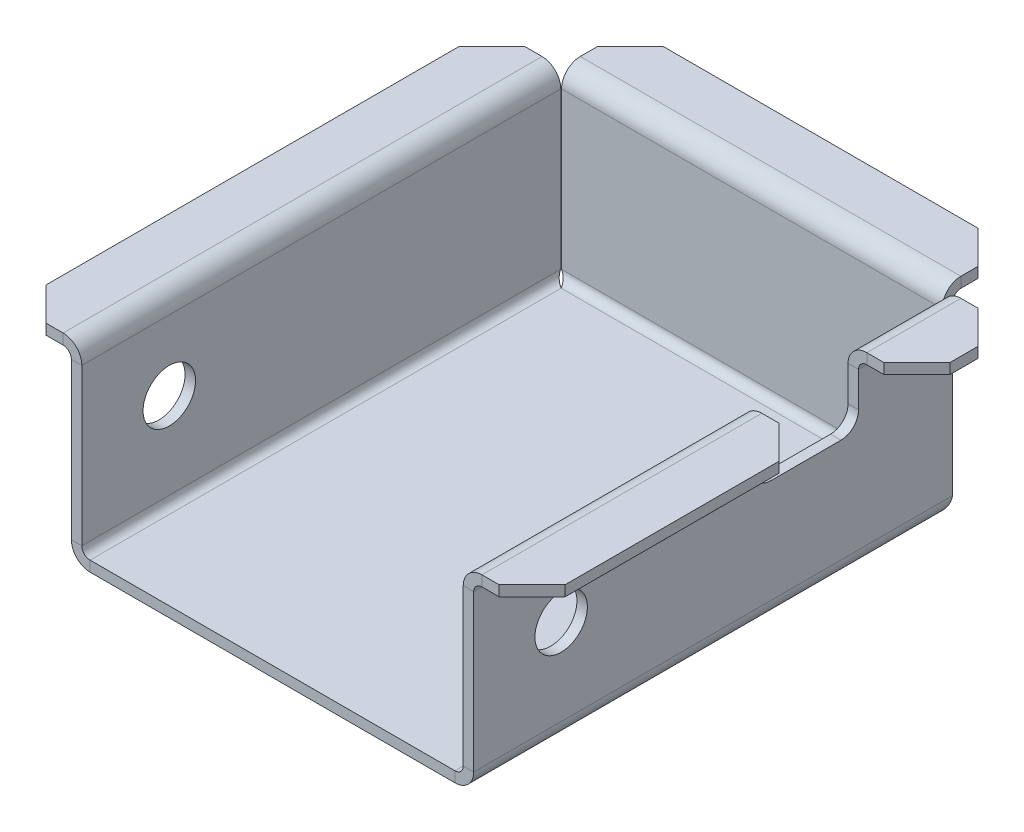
ISO-10303-21;
HEADER;
FILE_DESCRIPTION(('STEP AP214'),'2;1');
FILE_NAME('part.step','',(''),(''),'','','');
FILE_SCHEMA(('AUTOMOTIVE_DESIGN { 1 0 10303 214 1 1 1 1 }'));
ENDSEC;
DATA;
#1=APPLICATION_CONTEXT('core data for automotive mechanical design processes');
#2=APPLICATION_PROTOCOL_DEFINITION('international standard','automotive_design',2000,#1);
#3=PRODUCT_CONTEXT('',#1,'mechanical');
#4=PRODUCT('Part','Part','',(#3));
#5=PRODUCT_RELATED_PRODUCT_CATEGORY('part','',(#4));
#6=PRODUCT_DEFINITION_FORMATION('','',#4);
#7=PRODUCT_DEFINITION_CONTEXT('part definition',#1,'design');
#8=PRODUCT_DEFINITION('design','',#6,#7);
#9=PRODUCT_DEFINITION_SHAPE('','',#8);
#10=(LENGTH_UNIT() NAMED_UNIT(*) SI_UNIT(.MILLI.,.METRE.));
#11=(NAMED_UNIT(*) PLANE_ANGLE_UNIT() SI_UNIT($,.RADIAN.));
#12=(NAMED_UNIT(*) SI_UNIT($,.STERADIAN.) SOLID_ANGLE_UNIT());
#13=UNCERTAINTY_MEASURE_WITH_UNIT(LENGTH_MEASURE(1.E-05),#10,'distance_accuracy_value','');
#14=(GEOMETRIC_REPRESENTATION_CONTEXT(3) GLOBAL_UNCERTAINTY_ASSIGNED_CONTEXT((#13)) GLOBAL_UNIT_ASSIGNED_CONTEXT((#10,
#11,#12)) REPRESENTATION_CONTEXT('',''));
#15=CARTESIAN_POINT('',(0.,0.,0.));
#16=DIRECTION('',(0.,0.,1.));
#17=DIRECTION('',(1.,0.,0.));
#18=AXIS2_PLACEMENT_3D('',#15,#16,#17);
#19=CARTESIAN_POINT('',(-111.749693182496,1.89738000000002,38.1));
#20=DIRECTION('',(0.,0.,1.));
#21=DIRECTION('',(0.,1.,0.));
#22=AXIS2_PLACEMENT_3D('',#19,#20,#21);
#23=PLANE('',#22);
#24=DIRECTION('',(1.,0.,0.));
#25=VECTOR('',#24,1.);
#26=CARTESIAN_POINT('',(-111.749693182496,31.75,38.1));
#27=LINE('',#26,#25);
#28=CARTESIAN_POINT('',(71.12762,31.75,38.1));
#29=VERTEX_POINT('',#28);
#30=CARTESIAN_POINT('',(73.025,31.75,38.1));
#31=VERTEX_POINT('',#30);
#32=EDGE_CURVE('E1111',#29,#31,#27,.T.);
#33=ORIENTED_EDGE('',*,*,#32,.T.);
#34=DIRECTION('',(0.,-1.,0.));
#35=VECTOR('',#34,1.);
#36=CARTESIAN_POINT('',(73.025,31.75,38.1));
#37=LINE('',#36,#35);
#38=CARTESIAN_POINT('',(73.025,25.3999999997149,38.1));
#39=VERTEX_POINT('',#38);
#40=EDGE_CURVE('E1108',#31,#39,#37,.T.);
#41=ORIENTED_EDGE('',*,*,#40,.T.);
#42=DIRECTION('',(1.,0.,0.));
#43=VECTOR('',#42,1.);
#44=CARTESIAN_POINT('',(-111.749693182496,25.3999999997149,38.1));
#45=LINE('',#44,#43);
#46=CARTESIAN_POINT('',(71.12762,25.3999999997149,38.1));
#47=VERTEX_POINT('',#46);
#48=EDGE_CURVE('E1105',#47,#39,#45,.T.);
#49=ORIENTED_EDGE('',*,*,#48,.F.);
#50=DIRECTION('',(0.,1.,0.));
#51=VECTOR('',#50,1.);
#52=CARTESIAN_POINT('',(71.12762,1.89738000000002,38.1));
#53=LINE('',#52,#51);
#54=EDGE_CURVE('E1054',#29,#47,#53,.F.);
#55=ORIENTED_EDGE('',*,*,#54,.F.);
#56=EDGE_LOOP('',(#33,#41,#49,#55));
#57=FACE_BOUND('',#56,.T.);
#58=ADVANCED_FACE('F190',(#57),#23,.F.);
#59=CARTESIAN_POINT('',(-111.749693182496,25.4,34.925));
#60=DIRECTION('',(1.,0.,0.));
#61=DIRECTION('',(0.,1.,0.));
#62=AXIS2_PLACEMENT_3D('',#59,#60,#61);
#63=CYLINDRICAL_SURFACE('',#62,3.175);
#64=ORIENTED_EDGE('',*,*,#48,.T.);
#65=CARTESIAN_POINT('',(73.025,25.4,34.925));
#66=DIRECTION('',(-1.,0.,0.));
#67=DIRECTION('',(0.,0.,1.));
#68=AXIS2_PLACEMENT_3D('',#65,#66,#67);
#69=CIRCLE('',#68,3.175);
#70=CARTESIAN_POINT('',(73.025,22.225,34.925));
#71=VERTEX_POINT('',#70);
#72=EDGE_CURVE('E1102',#39,#71,#69,.F.);
#73=ORIENTED_EDGE('',*,*,#72,.T.);
#74=DIRECTION('',(1.,0.,0.));
#75=VECTOR('',#74,1.);
#76=CARTESIAN_POINT('',(-111.749693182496,22.225,34.925));
#77=LINE('',#76,#75);
#78=CARTESIAN_POINT('',(71.12762,22.225,34.925));
#79=VERTEX_POINT('',#78);
#80=EDGE_CURVE('E1099',#79,#71,#77,.T.);
#81=ORIENTED_EDGE('',*,*,#80,.F.);
#82=CARTESIAN_POINT('',(71.12762,25.4,34.925));
#83=DIRECTION('',(-1.,0.,0.));
#84=DIRECTION('',(0.,0.,1.));
#85=AXIS2_PLACEMENT_3D('',#82,#83,#84);
#86=CIRCLE('',#85,3.175);
#87=EDGE_CURVE('E1051',#47,#79,#86,.F.);
#88=ORIENTED_EDGE('',*,*,#87,.F.);
#89=EDGE_LOOP('',(#64,#73,#81,#88));
#90=FACE_BOUND('',#89,.T.);
#91=ADVANCED_FACE('F1189',(#90),#63,.F.);
#92=CARTESIAN_POINT('',(-111.749693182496,22.225,1.89738));
#93=DIRECTION('',(0.,-1.,0.));
#94=DIRECTION('',(1.,0.,0.));
#95=AXIS2_PLACEMENT_3D('',#92,#93,#94);
#96=PLANE('',#95);
#97=ORIENTED_EDGE('',*,*,#80,.T.);
#98=DIRECTION('',(0.,0.,-1.));
#99=VECTOR('',#98,1.);
#100=CARTESIAN_POINT('',(73.025,22.225,34.925));
#101=LINE('',#100,#99);
#102=CARTESIAN_POINT('',(73.025,22.225,22.2249999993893));
#103=VERTEX_POINT('',#102);
#104=EDGE_CURVE('E1096',#71,#103,#101,.T.);
#105=ORIENTED_EDGE('',*,*,#104,.T.);
#106=DIRECTION('',(1.,0.,0.));
#107=VECTOR('',#106,1.);
#108=CARTESIAN_POINT('',(-111.749693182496,22.225,22.2249999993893));
#109=LINE('',#108,#107);
#110=CARTESIAN_POINT('',(71.12762,22.225,22.2249999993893));
#111=VERTEX_POINT('',#110);
#112=EDGE_CURVE('E1093',#111,#103,#109,.T.);
#113=ORIENTED_EDGE('',*,*,#112,.F.);
#114=DIRECTION('',(0.,0.,1.));
#115=VECTOR('',#114,1.);
#116=CARTESIAN_POINT('',(71.12762,22.225,1.89738));
#117=LINE('',#116,#115);
#118=EDGE_CURVE('E1048',#79,#111,#117,.F.);
#119=ORIENTED_EDGE('',*,*,#118,.F.);
#120=EDGE_LOOP('',(#97,#105,#113,#119));
#121=FACE_BOUND('',#120,.T.);
#122=ADVANCED_FACE('F1195',(#121),#96,.F.);
#123=CARTESIAN_POINT('',(-111.749693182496,25.4,22.225));
#124=DIRECTION('',(1.,0.,0.));
#125=DIRECTION('',(0.,1.,0.));
#126=AXIS2_PLACEMENT_3D('',#123,#124,#125);
#127=CYLINDRICAL_SURFACE('',#126,3.175);
#128=ORIENTED_EDGE('',*,*,#112,.T.);
#129=CARTESIAN_POINT('',(73.025,25.4,22.225));
#130=DIRECTION('',(-1.,0.,0.));
#131=DIRECTION('',(0.,0.,1.));
#132=AXIS2_PLACEMENT_3D('',#129,#130,#131);
#133=CIRCLE('',#132,3.175);
#134=CARTESIAN_POINT('',(73.025,25.4,19.05));
#135=VERTEX_POINT('',#134);
#136=EDGE_CURVE('E1090',#103,#135,#133,.F.);
#137=ORIENTED_EDGE('',*,*,#136,.T.);
#138=DIRECTION('',(1.,0.,0.));
#139=VECTOR('',#138,1.);
#140=CARTESIAN_POINT('',(-111.749693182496,25.4,19.05));
#141=LINE('',#140,#139);
#142=CARTESIAN_POINT('',(71.12762,25.4,19.05));
#143=VERTEX_POINT('',#142);
#144=EDGE_CURVE('E1087',#143,#135,#141,.T.);
#145=ORIENTED_EDGE('',*,*,#144,.F.);
#146=CARTESIAN_POINT('',(71.12762,25.4,22.225));
#147=DIRECTION('',(-1.,0.,0.));
#148=DIRECTION('',(0.,0.,1.));
#149=AXIS2_PLACEMENT_3D('',#146,#147,#148);
#150=CIRCLE('',#149,3.175);
#151=EDGE_CURVE('E1045',#111,#143,#150,.F.);
#152=ORIENTED_EDGE('',*,*,#151,.F.);
#153=EDGE_LOOP('',(#128,#137,#145,#152));
#154=FACE_BOUND('',#153,.T.);
#155=ADVANCED_FACE('F1203',(#154),#127,.F.);
#156=CARTESIAN_POINT('',(-111.749693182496,1.89738000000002,19.05));
#157=DIRECTION('',(0.,0.,-1.));
#158=DIRECTION('',(0.,-1.,0.));
#159=AXIS2_PLACEMENT_3D('',#156,#157,#158);
#160=PLANE('',#159);
#161=ORIENTED_EDGE('',*,*,#144,.T.);
#162=DIRECTION('',(0.,1.,0.));
#163=VECTOR('',#162,1.);
#164=CARTESIAN_POINT('',(73.025,25.4,19.05));
#165=LINE('',#164,#163);
#166=CARTESIAN_POINT('',(73.025,31.75,19.05));
#167=VERTEX_POINT('',#166);
#168=EDGE_CURVE('E1084',#135,#167,#165,.T.);
#169=ORIENTED_EDGE('',*,*,#168,.T.);
#170=DIRECTION('',(1.,0.,0.));
#171=VECTOR('',#170,1.);
#172=CARTESIAN_POINT('',(-111.749693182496,31.75,19.05));
#173=LINE('',#172,#171);
#174=CARTESIAN_POINT('',(71.12762,31.75,19.05));
#175=VERTEX_POINT('',#174);
#176=EDGE_CURVE('E1082',#175,#167,#173,.T.);
#177=ORIENTED_EDGE('',*,*,#176,.F.);
#178=DIRECTION('',(0.,-1.,0.));
#179=VECTOR('',#178,1.);
#180=CARTESIAN_POINT('',(71.12762,1.89738000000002,19.05));
#181=LINE('',#180,#179);
#182=EDGE_CURVE('E1042',#143,#175,#181,.F.);
#183=ORIENTED_EDGE('',*,*,#182,.F.);
#184=EDGE_LOOP('',(#161,#169,#177,#183));
#185=FACE_BOUND('',#184,.T.);
#186=ADVANCED_FACE('F1207',(#185),#160,.F.);
#187=CARTESIAN_POINT('',(71.12762,19.05,73.025));
#188=DIRECTION('',(1.,0.,0.));
#189=DIRECTION('',(0.,0.,-1.));
#190=AXIS2_PLACEMENT_3D('',#187,#188,#189);
#191=CYLINDRICAL_SURFACE('',#190,4.76249999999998);
#192=CARTESIAN_POINT('',(71.12762,19.05,73.025));
#193=DIRECTION('',(-1.,0.,0.));
#194=DIRECTION('',(0.,0.,1.));
#195=AXIS2_PLACEMENT_3D('',#192,#193,#194);
#196=CIRCLE('',#195,4.76249999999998);
#197=CARTESIAN_POINT('',(71.12762,19.05,77.7875));
#198=VERTEX_POINT('',#197);
#199=EDGE_CURVE('E1029',#198,#198,#196,.F.);
#200=ORIENTED_EDGE('',*,*,#199,.F.);
#201=EDGE_LOOP('',(#200));
#202=FACE_BOUND('',#201,.T.);
#203=CARTESIAN_POINT('',(73.025,19.05,73.025));
#204=DIRECTION('',(-1.,0.,0.));
#205=DIRECTION('',(0.,0.,1.));
#206=AXIS2_PLACEMENT_3D('',#203,#204,#205);
#207=CIRCLE('',#206,4.76249999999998);
#208=CARTESIAN_POINT('',(73.025,19.05,77.7875));
#209=VERTEX_POINT('',#208);
#210=EDGE_CURVE('E1079',#209,#209,#207,.F.);
#211=ORIENTED_EDGE('',*,*,#210,.T.);
#212=EDGE_LOOP('',(#211));
#213=FACE_BOUND('',#212,.T.);
#214=ADVANCED_FACE('F1211',(#202,#213),#191,.F.);
#215=CARTESIAN_POINT('',(-111.749693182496,1.89738000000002,88.9));
#216=DIRECTION('',(0.,0.,-1.));
#217=DIRECTION('',(0.,-1.,0.));
#218=AXIS2_PLACEMENT_3D('',#215,#216,#217);
#219=PLANE('',#218);
#220=DIRECTION('',(1.,0.,0.));
#221=VECTOR('',#220,1.);
#222=CARTESIAN_POINT('',(-111.749693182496,3.39738000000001,88.9));
#223=LINE('',#222,#221);
#224=CARTESIAN_POINT('',(71.12762,3.39738,88.9));
#225=VERTEX_POINT('',#224);
#226=CARTESIAN_POINT('',(73.025,3.39738,88.9));
#227=VERTEX_POINT('',#226);
#228=EDGE_CURVE('E1072',#225,#227,#223,.T.);
#229=ORIENTED_EDGE('',*,*,#228,.T.);
#230=DIRECTION('',(0.,-1.,0.));
#231=VECTOR('',#230,1.);
#232=CARTESIAN_POINT('',(73.025,0.,88.9));
#233=LINE('',#232,#231);
#234=CARTESIAN_POINT('',(73.025,31.75,88.9));
#235=VERTEX_POINT('',#234);
#236=EDGE_CURVE('E1069',#235,#227,#233,.T.);
#237=ORIENTED_EDGE('',*,*,#236,.F.);
#238=DIRECTION('',(1.,0.,0.));
#239=VECTOR('',#238,1.);
#240=CARTESIAN_POINT('',(-111.749693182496,31.75,88.9));
#241=LINE('',#240,#239);
#242=CARTESIAN_POINT('',(71.12762,31.75,88.9));
#243=VERTEX_POINT('',#242);
#244=EDGE_CURVE('E1077',#243,#235,#241,.T.);
#245=ORIENTED_EDGE('',*,*,#244,.F.);
#246=DIRECTION('',(0.,-1.,0.));
#247=VECTOR('',#246,1.);
#248=CARTESIAN_POINT('',(71.12762,1.89738000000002,88.9));
#249=LINE('',#248,#247);
#250=EDGE_CURVE('E1058',#225,#243,#249,.F.);
#251=ORIENTED_EDGE('',*,*,#250,.F.);
#252=EDGE_LOOP('',(#229,#237,#245,#251));
#253=FACE_BOUND('',#252,.T.);
#254=ADVANCED_FACE('F1214',(#253),#219,.F.);
#255=CARTESIAN_POINT('',(73.025,0.,0.));
#256=DIRECTION('',(-1.,0.,0.));
#257=DIRECTION('',(0.,0.,1.));
#258=AXIS2_PLACEMENT_3D('',#255,#256,#257);
#259=PLANE('',#258);
#260=ORIENTED_EDGE('',*,*,#210,.F.);
#261=EDGE_LOOP('',(#260));
#262=FACE_BOUND('',#261,.T.);
#263=ORIENTED_EDGE('',*,*,#236,.T.);
#264=DIRECTION('',(0.,0.,-1.));
#265=VECTOR('',#264,1.);
#266=CARTESIAN_POINT('',(73.025,3.39738000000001,88.9));
#267=LINE('',#266,#265);
#268=CARTESIAN_POINT('',(73.025,3.39738000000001,1.96809067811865));
#269=VERTEX_POINT('',#268);
#270=EDGE_CURVE('E1068',#227,#269,#267,.T.);
#271=ORIENTED_EDGE('',*,*,#270,.T.);
#272=DIRECTION('',(0.,-1.,0.));
#273=VECTOR('',#272,1.);
#274=CARTESIAN_POINT('',(73.025,1.89738000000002,1.96809067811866));
#275=LINE('',#274,#273);
#276=CARTESIAN_POINT('',(73.025,31.75,1.96809067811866));
#277=VERTEX_POINT('',#276);
#278=EDGE_CURVE('E1061',#277,#269,#275,.T.);
#279=ORIENTED_EDGE('',*,*,#278,.F.);
#280=DIRECTION('',(0.,0.,1.));
#281=VECTOR('',#280,1.);
#282=CARTESIAN_POINT('',(73.025,31.75,0.));
#283=LINE('',#282,#281);
#284=EDGE_CURVE('E1065',#277,#167,#283,.T.);
#285=ORIENTED_EDGE('',*,*,#284,.T.);
#286=ORIENTED_EDGE('',*,*,#168,.F.);
#287=ORIENTED_EDGE('',*,*,#136,.F.);
#288=ORIENTED_EDGE('',*,*,#104,.F.);
#289=ORIENTED_EDGE('',*,*,#72,.F.);
#290=ORIENTED_EDGE('',*,*,#40,.F.);
#291=DIRECTION('',(0.,0.,-1.));
#292=VECTOR('',#291,1.);
#293=CARTESIAN_POINT('',(73.025,31.75,88.9));
#294=LINE('',#293,#292);
#295=EDGE_CURVE('E1075',#235,#31,#294,.T.);
#296=ORIENTED_EDGE('',*,*,#295,.F.);
#297=EDGE_LOOP('',(#263,#271,#279,#285,#286,#287,#288,#289,#290,#296));
#298=FACE_BOUND('',#297,.T.);
#299=ADVANCED_FACE('F1152',(#262,#298),#259,.F.);
#300=CARTESIAN_POINT('',(-111.749693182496,1.89738000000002,1.96809067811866));
#301=DIRECTION('',(0.,0.,1.));
#302=DIRECTION('',(0.,1.,0.));
#303=AXIS2_PLACEMENT_3D('',#300,#301,#302);
#304=PLANE('',#303);
#305=DIRECTION('',(1.,0.,0.));
#306=VECTOR('',#305,1.);
#307=CARTESIAN_POINT('',(-111.749693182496,31.75,1.96809067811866));
#308=LINE('',#307,#306);
#309=CARTESIAN_POINT('',(71.12762,31.75,1.96809067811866));
#310=VERTEX_POINT('',#309);
#311=EDGE_CURVE('E1062',#310,#277,#308,.T.);
#312=ORIENTED_EDGE('',*,*,#311,.T.);
#313=ORIENTED_EDGE('',*,*,#278,.T.);
#314=CARTESIAN_POINT('',(71.12762,3.39737999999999,1.96809067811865));
#315=CARTESIAN_POINT('',(73.025,3.39737999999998,1.96809067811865));
#316=B_SPLINE_CURVE_WITH_KNOTS('',1,(#314,#315),.UNSPECIFIED.,.F.,.F.,(2,2),(0.,1.),.UNSPECIFIED.);
#317=CARTESIAN_POINT('',(71.12762,3.39737999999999,1.96809067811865));
#318=VERTEX_POINT('',#317);
#319=EDGE_CURVE('E1114',#318,#269,#316,.T.);
#320=ORIENTED_EDGE('',*,*,#319,.F.);
#321=DIRECTION('',(0.,-1.,0.));
#322=VECTOR('',#321,1.);
#323=CARTESIAN_POINT('',(71.12762,1.89738000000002,1.96809067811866));
#324=LINE('',#323,#322);
#325=EDGE_CURVE('E1038',#310,#318,#324,.T.);
#326=ORIENTED_EDGE('',*,*,#325,.F.);
#327=EDGE_LOOP('',(#312,#313,#320,#326));
#328=FACE_BOUND('',#327,.T.);
#329=ADVANCED_FACE('F1142',(#328),#304,.F.);
#330=CARTESIAN_POINT('',(71.12762,1.89738000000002,1.89738));
#331=DIRECTION('',(-1.,0.,0.));
#332=DIRECTION('',(0.,0.,1.));
#333=AXIS2_PLACEMENT_3D('',#330,#331,#332);
#334=PLANE('',#333);
#335=DIRECTION('',(0.,0.,-1.));
#336=VECTOR('',#335,1.);
#337=CARTESIAN_POINT('',(71.12762,3.39738000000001,88.9));
#338=LINE('',#337,#336);
#339=EDGE_CURVE('E1123',#225,#318,#338,.T.);
#340=ORIENTED_EDGE('',*,*,#339,.F.);
#341=ORIENTED_EDGE('',*,*,#250,.T.);
#342=DIRECTION('',(0.,0.,1.));
#343=VECTOR('',#342,1.);
#344=CARTESIAN_POINT('',(71.12762,31.75,1.89738));
#345=LINE('',#344,#343);
#346=EDGE_CURVE('E503',#243,#29,#345,.F.);
#347=ORIENTED_EDGE('',*,*,#346,.T.);
#348=ORIENTED_EDGE('',*,*,#54,.T.);
#349=ORIENTED_EDGE('',*,*,#87,.T.);
#350=ORIENTED_EDGE('',*,*,#118,.T.);
#351=ORIENTED_EDGE('',*,*,#151,.T.);
#352=ORIENTED_EDGE('',*,*,#182,.T.);
#353=DIRECTION('',(0.,0.,1.));
#354=VECTOR('',#353,1.);
#355=CARTESIAN_POINT('',(71.12762,31.75,1.89738));
#356=LINE('',#355,#354);
#357=EDGE_CURVE('E1039',#175,#310,#356,.F.);
#358=ORIENTED_EDGE('',*,*,#357,.T.);
#359=ORIENTED_EDGE('',*,*,#325,.T.);
#360=EDGE_LOOP('',(#340,#341,#347,#348,#349,#350,#351,#352,#358,#359));
#361=FACE_BOUND('',#360,.T.);
#362=ORIENTED_EDGE('',*,*,#199,.T.);
#363=EDGE_LOOP('',(#362));
#364=FACE_BOUND('',#363,.T.);
#365=ADVANCED_FACE('F1020',(#361,#364),#334,.T.);
#366=CARTESIAN_POINT('',(71.0569093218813,1.89738,151.257828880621));
#367=DIRECTION('',(1.,0.,0.));
#368=DIRECTION('',(0.,1.,0.));
#369=AXIS2_PLACEMENT_3D('',#366,#367,#368);
#370=PLANE('',#369);
#371=CARTESIAN_POINT('',(71.0569093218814,3.39738,0.));
#372=CARTESIAN_POINT('',(71.0569093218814,3.39738,1.89738));
#373=B_SPLINE_CURVE_WITH_KNOTS('',1,(#371,#372),.UNSPECIFIED.,.F.,.F.,(2,2),(0.,1.),.UNSPECIFIED.);
#374=CARTESIAN_POINT('',(71.0569093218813,3.39738,1.89738));
#375=VERTEX_POINT('',#374);
#376=CARTESIAN_POINT('',(71.0569093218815,3.39738,0.));
#377=VERTEX_POINT('',#376);
#378=EDGE_CURVE('E1251',#375,#377,#373,.F.);
#379=ORIENTED_EDGE('',*,*,#378,.T.);
#380=DIRECTION('',(0.,1.,0.));
#381=VECTOR('',#380,1.);
#382=CARTESIAN_POINT('',(71.0569093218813,-16.82369,0.));
#383=LINE('',#382,#381);
#384=CARTESIAN_POINT('',(71.0569093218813,31.75,0.));
#385=VERTEX_POINT('',#384);
#386=EDGE_CURVE('E1253',#377,#385,#383,.T.);
#387=ORIENTED_EDGE('',*,*,#386,.T.);
#388=DIRECTION('',(0.,0.,-1.));
#389=VECTOR('',#388,1.);
#390=CARTESIAN_POINT('',(71.0569093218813,31.75,151.257828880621));
#391=LINE('',#390,#389);
#392=CARTESIAN_POINT('',(71.0569093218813,31.75,1.89738000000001));
#393=VERTEX_POINT('',#392);
#394=EDGE_CURVE('E1249',#393,#385,#391,.T.);
#395=ORIENTED_EDGE('',*,*,#394,.F.);
#396=DIRECTION('',(0.,-1.,0.));
#397=VECTOR('',#396,1.);
#398=CARTESIAN_POINT('',(71.0569093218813,1.89738,1.89738));
#399=LINE('',#398,#397);
#400=EDGE_CURVE('E1248',#393,#375,#399,.T.);
#401=ORIENTED_EDGE('',*,*,#400,.T.);
#402=EDGE_LOOP('',(#379,#387,#395,#401));
#403=FACE_BOUND('',#402,.T.);
#404=ADVANCED_FACE('F1015',(#403),#370,.T.);
#405=CARTESIAN_POINT('',(73.025,0.,0.));
#406=DIRECTION('',(0.,0.,-1.));
#407=DIRECTION('',(-1.,0.,0.));
#408=AXIS2_PLACEMENT_3D('',#405,#406,#407);
#409=PLANE('',#408);
#410=DIRECTION('',(1.,0.,0.));
#411=VECTOR('',#410,1.);
#412=CARTESIAN_POINT('',(71.0569093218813,3.39738,0.));
#413=LINE('',#412,#411);
#414=CARTESIAN_POINT('',(1.96809067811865,3.39738,0.));
#415=VERTEX_POINT('',#414);
#416=EDGE_CURVE('E1252',#415,#377,#413,.T.);
#417=ORIENTED_EDGE('',*,*,#416,.F.);
#418=DIRECTION('',(0.,-1.,0.));
#419=VECTOR('',#418,1.);
#420=CARTESIAN_POINT('',(1.96809067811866,50.47107,0.));
#421=LINE('',#420,#419);
#422=CARTESIAN_POINT('',(1.96809067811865,31.75,0.));
#423=VERTEX_POINT('',#422);
#424=EDGE_CURVE('E1244',#423,#415,#421,.T.);
#425=ORIENTED_EDGE('',*,*,#424,.F.);
#426=DIRECTION('',(-1.,0.,0.));
#427=VECTOR('',#426,1.);
#428=CARTESIAN_POINT('',(73.025,31.75,0.));
#429=LINE('',#428,#427);
#430=EDGE_CURVE('E1245',#423,#385,#429,.F.);
#431=ORIENTED_EDGE('',*,*,#430,.T.);
#432=ORIENTED_EDGE('',*,*,#386,.F.);
#433=EDGE_LOOP('',(#417,#425,#431,#432));
#434=FACE_BOUND('',#433,.T.);
#435=ADVANCED_FACE('F1019',(#434),#409,.T.);
#436=CARTESIAN_POINT('',(1.96809067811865,1.89738,151.257828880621));
#437=DIRECTION('',(-1.,0.,0.));
#438=DIRECTION('',(0.,-1.,0.));
#439=AXIS2_PLACEMENT_3D('',#436,#437,#438);
#440=PLANE('',#439);
#441=DIRECTION('',(0.,0.,-1.));
#442=VECTOR('',#441,1.);
#443=CARTESIAN_POINT('',(1.96809067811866,31.75,151.257828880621));
#444=LINE('',#443,#442);
#445=CARTESIAN_POINT('',(1.96809067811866,31.75,1.89738));
#446=VERTEX_POINT('',#445);
#447=EDGE_CURVE('E1241',#446,#423,#444,.T.);
#448=ORIENTED_EDGE('',*,*,#447,.T.);
#449=ORIENTED_EDGE('',*,*,#424,.T.);
#450=CARTESIAN_POINT('',(1.96809067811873,3.39738,1.89738));
#451=CARTESIAN_POINT('',(1.96809067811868,3.39738,0.));
#452=B_SPLINE_CURVE_WITH_KNOTS('',1,(#450,#451),.UNSPECIFIED.,.F.,.F.,(2,2),(0.,1.),.UNSPECIFIED.);
#453=CARTESIAN_POINT('',(1.96809067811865,3.39738,1.89738));
#454=VERTEX_POINT('',#453);
#455=EDGE_CURVE('E945',#454,#415,#452,.T.);
#456=ORIENTED_EDGE('',*,*,#455,.F.);
#457=DIRECTION('',(0.,-1.,0.));
#458=VECTOR('',#457,1.);
#459=CARTESIAN_POINT('',(1.96809067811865,1.89738,1.89738));
#460=LINE('',#459,#458);
#461=EDGE_CURVE('E1264',#446,#454,#460,.T.);
#462=ORIENTED_EDGE('',*,*,#461,.F.);
#463=EDGE_LOOP('',(#448,#449,#456,#462));
#464=FACE_BOUND('',#463,.T.);
#465=ADVANCED_FACE('F1275',(#464),#440,.T.);
#466=CARTESIAN_POINT('',(71.12762,1.89738,1.89738));
#467=DIRECTION('',(0.,0.,-1.));
#468=DIRECTION('',(-1.,0.,0.));
#469=AXIS2_PLACEMENT_3D('',#466,#467,#468);
#470=PLANE('',#469);
#471=ORIENTED_EDGE('',*,*,#461,.T.);
#472=DIRECTION('',(1.,0.,0.));
#473=VECTOR('',#472,1.);
#474=CARTESIAN_POINT('',(71.0569093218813,3.39738,1.89738));
#475=LINE('',#474,#473);
#476=EDGE_CURVE('E1240',#454,#375,#475,.T.);
#477=ORIENTED_EDGE('',*,*,#476,.T.);
#478=ORIENTED_EDGE('',*,*,#400,.F.);
#479=DIRECTION('',(-1.,0.,0.));
#480=VECTOR('',#479,1.);
#481=CARTESIAN_POINT('',(71.12762,31.75,1.89738));
#482=LINE('',#481,#480);
#483=EDGE_CURVE('E1126',#393,#446,#482,.T.);
#484=ORIENTED_EDGE('',*,*,#483,.T.);
#485=EDGE_LOOP('',(#471,#477,#478,#484));
#486=FACE_BOUND('',#485,.T.);
#487=ADVANCED_FACE('F1199',(#486),#470,.F.);
#488=CARTESIAN_POINT('',(0.,19.05,73.025));
#489=DIRECTION('',(1.,0.,0.));
#490=DIRECTION('',(0.,0.,-1.));
#491=AXIS2_PLACEMENT_3D('',#488,#489,#490);
#492=CYLINDRICAL_SURFACE('',#491,4.76249999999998);
#493=CARTESIAN_POINT('',(1.89738,19.05,73.025));
#494=DIRECTION('',(1.,0.,0.));
#495=DIRECTION('',(0.,0.,-1.));
#496=AXIS2_PLACEMENT_3D('',#493,#494,#495);
#497=CIRCLE('',#496,4.76249999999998);
#498=CARTESIAN_POINT('',(1.89738,19.05,68.2625));
#499=VERTEX_POINT('',#498);
#500=EDGE_CURVE('E965',#499,#499,#497,.T.);
#501=ORIENTED_EDGE('',*,*,#500,.T.);
#502=EDGE_LOOP('',(#501));
#503=FACE_BOUND('',#502,.T.);
#504=CARTESIAN_POINT('',(0.,19.05,73.025));
#505=DIRECTION('',(1.,0.,0.));
#506=DIRECTION('',(0.,0.,-1.));
#507=AXIS2_PLACEMENT_3D('',#504,#505,#506);
#508=CIRCLE('',#507,4.76249999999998);
#509=CARTESIAN_POINT('',(0.,19.05,68.2625));
#510=VERTEX_POINT('',#509);
#511=EDGE_CURVE('E962',#510,#510,#508,.F.);
#512=ORIENTED_EDGE('',*,*,#511,.T.);
#513=EDGE_LOOP('',(#512));
#514=FACE_BOUND('',#513,.T.);
#515=ADVANCED_FACE('F1001',(#503,#514),#492,.F.);
#516=CARTESIAN_POINT('',(184.774693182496,1.89738,1.96809067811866));
#517=DIRECTION('',(0.,0.,1.));
#518=DIRECTION('',(0.,-1.,0.));
#519=AXIS2_PLACEMENT_3D('',#516,#517,#518);
#520=PLANE('',#519);
#521=CARTESIAN_POINT('',(0.,3.39738,1.96809067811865));
#522=CARTESIAN_POINT('',(1.89738,3.39738,1.96809067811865));
#523=B_SPLINE_CURVE_WITH_KNOTS('',1,(#521,#522),.UNSPECIFIED.,.F.,.F.,(2,2),(0.,1.),.UNSPECIFIED.);
#524=CARTESIAN_POINT('',(1.89738,3.39738,1.96809067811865));
#525=VERTEX_POINT('',#524);
#526=CARTESIAN_POINT('',(0.,3.39737999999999,1.96809067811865));
#527=VERTEX_POINT('',#526);
#528=EDGE_CURVE('E959',#525,#527,#523,.F.);
#529=ORIENTED_EDGE('',*,*,#528,.T.);
#530=DIRECTION('',(0.,-1.,0.));
#531=VECTOR('',#530,1.);
#532=CARTESIAN_POINT('',(0.,50.47107,1.96809067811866));
#533=LINE('',#532,#531);
#534=CARTESIAN_POINT('',(0.,31.75,1.96809067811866));
#535=VERTEX_POINT('',#534);
#536=EDGE_CURVE('E973',#535,#527,#533,.T.);
#537=ORIENTED_EDGE('',*,*,#536,.F.);
#538=DIRECTION('',(-1.,0.,0.));
#539=VECTOR('',#538,1.);
#540=CARTESIAN_POINT('',(184.774693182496,31.75,1.96809067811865));
#541=LINE('',#540,#539);
#542=CARTESIAN_POINT('',(1.89738,31.75,1.96809067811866));
#543=VERTEX_POINT('',#542);
#544=EDGE_CURVE('E960',#543,#535,#541,.T.);
#545=ORIENTED_EDGE('',*,*,#544,.F.);
#546=DIRECTION('',(0.,1.,0.));
#547=VECTOR('',#546,1.);
#548=CARTESIAN_POINT('',(1.89738,1.89738,1.96809067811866));
#549=LINE('',#548,#547);
#550=EDGE_CURVE('E949',#525,#543,#549,.T.);
#551=ORIENTED_EDGE('',*,*,#550,.F.);
#552=EDGE_LOOP('',(#529,#537,#545,#551));
#553=FACE_BOUND('',#552,.T.);
#554=ADVANCED_FACE('F990',(#553),#520,.F.);
#555=CARTESIAN_POINT('',(0.,0.,88.9));
#556=DIRECTION('',(1.,0.,0.));
#557=DIRECTION('',(0.,0.,-1.));
#558=AXIS2_PLACEMENT_3D('',#555,#556,#557);
#559=PLANE('',#558);
#560=ORIENTED_EDGE('',*,*,#511,.F.);
#561=EDGE_LOOP('',(#560));
#562=FACE_BOUND('',#561,.T.);
#563=ORIENTED_EDGE('',*,*,#536,.T.);
#564=DIRECTION('',(0.,0.,1.));
#565=VECTOR('',#564,1.);
#566=CARTESIAN_POINT('',(0.,3.39738,1.96809067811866));
#567=LINE('',#566,#565);
#568=CARTESIAN_POINT('',(0.,3.39738,88.9));
#569=VERTEX_POINT('',#568);
#570=EDGE_CURVE('E956',#527,#569,#567,.T.);
#571=ORIENTED_EDGE('',*,*,#570,.T.);
#572=DIRECTION('',(0.,-1.,0.));
#573=VECTOR('',#572,1.);
#574=CARTESIAN_POINT('',(0.,0.,88.9));
#575=LINE('',#574,#573);
#576=CARTESIAN_POINT('',(0.,31.75,88.9));
#577=VERTEX_POINT('',#576);
#578=EDGE_CURVE('E950',#577,#569,#575,.T.);
#579=ORIENTED_EDGE('',*,*,#578,.F.);
#580=DIRECTION('',(0.,0.,1.));
#581=VECTOR('',#580,1.);
#582=CARTESIAN_POINT('',(0.,31.75,88.9));
#583=LINE('',#582,#581);
#584=EDGE_CURVE('E957',#535,#577,#583,.T.);
#585=ORIENTED_EDGE('',*,*,#584,.F.);
#586=EDGE_LOOP('',(#563,#571,#579,#585));
#587=FACE_BOUND('',#586,.T.);
#588=ADVANCED_FACE('F1000',(#562,#587),#559,.F.);
#589=CARTESIAN_POINT('',(184.774693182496,1.89738,88.9));
#590=DIRECTION('',(0.,0.,-1.));
#591=DIRECTION('',(0.,1.,0.));
#592=AXIS2_PLACEMENT_3D('',#589,#590,#591);
#593=PLANE('',#592);
#594=DIRECTION('',(-1.,0.,0.));
#595=VECTOR('',#594,1.);
#596=CARTESIAN_POINT('',(184.774693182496,31.75,88.9));
#597=LINE('',#596,#595);
#598=CARTESIAN_POINT('',(1.89738,31.75,88.9));
#599=VERTEX_POINT('',#598);
#600=EDGE_CURVE('E953',#599,#577,#597,.T.);
#601=ORIENTED_EDGE('',*,*,#600,.T.);
#602=ORIENTED_EDGE('',*,*,#578,.T.);
#603=DIRECTION('',(-1.,0.,0.));
#604=VECTOR('',#603,1.);
#605=CARTESIAN_POINT('',(184.774693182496,3.39738,88.9));
#606=LINE('',#605,#604);
#607=CARTESIAN_POINT('',(1.89738,3.39737999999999,88.9));
#608=VERTEX_POINT('',#607);
#609=EDGE_CURVE('E968',#608,#569,#606,.T.);
#610=ORIENTED_EDGE('',*,*,#609,.F.);
#611=DIRECTION('',(0.,1.,0.));
#612=VECTOR('',#611,1.);
#613=CARTESIAN_POINT('',(1.89738,1.89738,88.9));
#614=LINE('',#613,#612);
#615=EDGE_CURVE('E942',#599,#608,#614,.F.);
#616=ORIENTED_EDGE('',*,*,#615,.F.);
#617=EDGE_LOOP('',(#601,#602,#610,#616));
#618=FACE_BOUND('',#617,.T.);
#619=ADVANCED_FACE('F1005',(#618),#593,.F.);
#620=CARTESIAN_POINT('',(1.89738,1.89738,88.9));
#621=DIRECTION('',(1.,0.,0.));
#622=DIRECTION('',(0.,0.,-1.));
#623=AXIS2_PLACEMENT_3D('',#620,#621,#622);
#624=PLANE('',#623);
#625=DIRECTION('',(0.,0.,1.));
#626=VECTOR('',#625,1.);
#627=CARTESIAN_POINT('',(1.89738,3.39738,1.96809067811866));
#628=LINE('',#627,#626);
#629=EDGE_CURVE('E939',#525,#608,#628,.T.);
#630=ORIENTED_EDGE('',*,*,#629,.F.);
#631=ORIENTED_EDGE('',*,*,#550,.T.);
#632=DIRECTION('',(0.,0.,-1.));
#633=VECTOR('',#632,1.);
#634=CARTESIAN_POINT('',(1.89738,31.75,88.9));
#635=LINE('',#634,#633);
#636=EDGE_CURVE('E946',#543,#599,#635,.F.);
#637=ORIENTED_EDGE('',*,*,#636,.T.);
#638=ORIENTED_EDGE('',*,*,#615,.T.);
#639=EDGE_LOOP('',(#630,#631,#637,#638));
#640=FACE_BOUND('',#639,.T.);
#641=ORIENTED_EDGE('',*,*,#500,.F.);
#642=EDGE_LOOP('',(#641));
#643=FACE_BOUND('',#642,.T.);
#644=ADVANCED_FACE('F1009',(#640,#643),#624,.T.);
#645=CARTESIAN_POINT('',(0.,0.,0.));
#646=DIRECTION('',(0.,1.,0.));
#647=DIRECTION('',(0.,0.,1.));
#648=AXIS2_PLACEMENT_3D('',#645,#646,#647);
#649=PLANE('',#648);
#650=DIRECTION('',(0.,0.,-1.));
#651=VECTOR('',#650,1.);
#652=CARTESIAN_POINT('',(69.62762,0.,88.9));
#653=LINE('',#652,#651);
#654=CARTESIAN_POINT('',(69.62762,0.,88.9));
#655=VERTEX_POINT('',#654);
#656=CARTESIAN_POINT('',(69.62762,0.,3.39738));
#657=VERTEX_POINT('',#656);
#658=EDGE_CURVE('E918',#655,#657,#653,.T.);
#659=ORIENTED_EDGE('',*,*,#658,.F.);
#660=DIRECTION('',(-1.,0.,0.));
#661=VECTOR('',#660,1.);
#662=CARTESIAN_POINT('',(0.,0.,88.9));
#663=LINE('',#662,#661);
#664=CARTESIAN_POINT('',(3.39738,0.,88.9));
#665=VERTEX_POINT('',#664);
#666=EDGE_CURVE('E905',#655,#665,#663,.T.);
#667=ORIENTED_EDGE('',*,*,#666,.T.);
#668=DIRECTION('',(0.,0.,1.));
#669=VECTOR('',#668,1.);
#670=CARTESIAN_POINT('',(3.39738,0.,1.96809067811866));
#671=LINE('',#670,#669);
#672=CARTESIAN_POINT('',(3.39738,0.,3.39738000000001));
#673=VERTEX_POINT('',#672);
#674=EDGE_CURVE('E929',#673,#665,#671,.T.);
#675=ORIENTED_EDGE('',*,*,#674,.F.);
#676=DIRECTION('',(-1.,0.,0.));
#677=VECTOR('',#676,1.);
#678=CARTESIAN_POINT('',(71.0569093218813,0.,3.39738));
#679=LINE('',#678,#677);
#680=EDGE_CURVE('E913',#657,#673,#679,.T.);
#681=ORIENTED_EDGE('',*,*,#680,.F.);
#682=EDGE_LOOP('',(#659,#667,#675,#681));
#683=FACE_BOUND('',#682,.T.);
#684=ADVANCED_FACE('F1013',(#683),#649,.F.);
#685=CARTESIAN_POINT('',(1.89738,218.204039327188,88.9));
#686=DIRECTION('',(0.,0.,-1.));
#687=DIRECTION('',(-1.,0.,0.));
#688=AXIS2_PLACEMENT_3D('',#685,#686,#687);
#689=PLANE('',#688);
#690=DIRECTION('',(0.,-1.,0.));
#691=VECTOR('',#690,1.);
#692=CARTESIAN_POINT('',(3.39738,218.204039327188,88.9));
#693=LINE('',#692,#691);
#694=CARTESIAN_POINT('',(3.39738,1.89738,88.9));
#695=VERTEX_POINT('',#694);
#696=EDGE_CURVE('E919',#695,#665,#693,.T.);
#697=ORIENTED_EDGE('',*,*,#696,.T.);
#698=ORIENTED_EDGE('',*,*,#666,.F.);
#699=DIRECTION('',(0.,-1.,0.));
#700=VECTOR('',#699,1.);
#701=CARTESIAN_POINT('',(69.62762,218.204039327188,88.9));
#702=LINE('',#701,#700);
#703=CARTESIAN_POINT('',(69.62762,1.89738,88.9));
#704=VERTEX_POINT('',#703);
#705=EDGE_CURVE('E922',#704,#655,#702,.T.);
#706=ORIENTED_EDGE('',*,*,#705,.F.);
#707=DIRECTION('',(-1.,0.,0.));
#708=VECTOR('',#707,1.);
#709=CARTESIAN_POINT('',(1.89738,1.89738,88.9));
#710=LINE('',#709,#708);
#711=EDGE_CURVE('E914',#695,#704,#710,.F.);
#712=ORIENTED_EDGE('',*,*,#711,.F.);
#713=EDGE_LOOP('',(#697,#698,#706,#712));
#714=FACE_BOUND('',#713,.T.);
#715=ADVANCED_FACE('F1466',(#714),#689,.F.);
#716=CARTESIAN_POINT('',(1.89738,1.89738,1.89738));
#717=DIRECTION('',(0.,1.,0.));
#718=DIRECTION('',(0.,0.,1.));
#719=AXIS2_PLACEMENT_3D('',#716,#717,#718);
#720=PLANE('',#719);
#721=ORIENTED_EDGE('',*,*,#711,.T.);
#722=DIRECTION('',(0.,0.,-1.));
#723=VECTOR('',#722,1.);
#724=CARTESIAN_POINT('',(69.62762,1.89738,88.9));
#725=LINE('',#724,#723);
#726=CARTESIAN_POINT('',(69.62762,1.89738,3.39738000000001));
#727=VERTEX_POINT('',#726);
#728=EDGE_CURVE('E923',#704,#727,#725,.T.);
#729=ORIENTED_EDGE('',*,*,#728,.T.);
#730=DIRECTION('',(-1.,0.,0.));
#731=VECTOR('',#730,1.);
#732=CARTESIAN_POINT('',(71.0569093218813,1.89738,3.39738));
#733=LINE('',#732,#731);
#734=CARTESIAN_POINT('',(3.39738000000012,1.89738,3.39738));
#735=VERTEX_POINT('',#734);
#736=EDGE_CURVE('E917',#727,#735,#733,.T.);
#737=ORIENTED_EDGE('',*,*,#736,.T.);
#738=DIRECTION('',(0.,0.,1.));
#739=VECTOR('',#738,1.);
#740=CARTESIAN_POINT('',(3.39738,1.89738,1.96809067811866));
#741=LINE('',#740,#739);
#742=EDGE_CURVE('E926',#735,#695,#741,.T.);
#743=ORIENTED_EDGE('',*,*,#742,.T.);
#744=EDGE_LOOP('',(#721,#729,#737,#743));
#745=FACE_BOUND('',#744,.T.);
#746=ADVANCED_FACE('F1313',(#745),#720,.T.);
#747=CARTESIAN_POINT('',(3.39738,3.39738,88.9));
#748=DIRECTION('',(0.,0.,1.));
#749=DIRECTION('',(1.,0.,0.));
#750=AXIS2_PLACEMENT_3D('',#747,#748,#749);
#751=PLANE('',#750);
#752=ORIENTED_EDGE('',*,*,#696,.F.);
#753=CARTESIAN_POINT('',(3.39738,3.39738,88.9));
#754=DIRECTION('',(0.,0.,1.));
#755=DIRECTION('',(1.,0.,0.));
#756=AXIS2_PLACEMENT_3D('',#753,#754,#755);
#757=CIRCLE('',#756,1.5);
#758=EDGE_CURVE('E851',#695,#608,#757,.F.);
#759=ORIENTED_EDGE('',*,*,#758,.T.);
#760=ORIENTED_EDGE('',*,*,#609,.T.);
#761=CARTESIAN_POINT('',(3.39738,3.39738,88.9));
#762=DIRECTION('',(0.,0.,1.));
#763=DIRECTION('',(1.,0.,0.));
#764=AXIS2_PLACEMENT_3D('',#761,#762,#763);
#765=CIRCLE('',#764,3.39738);
#766=EDGE_CURVE('E840',#665,#569,#765,.F.);
#767=ORIENTED_EDGE('',*,*,#766,.F.);
#768=EDGE_LOOP('',(#752,#759,#760,#767));
#769=FACE_BOUND('',#768,.T.);
#770=ADVANCED_FACE('F869',(#769),#751,.T.);
#771=CARTESIAN_POINT('',(3.39738,0.,3.39738000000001));
#772=CARTESIAN_POINT('',(2.95258918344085,0.,3.2782525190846));
#773=CARTESIAN_POINT('',(2.50812297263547,0.0884247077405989,3.15916511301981));
#774=CARTESIAN_POINT('',(1.68639494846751,0.428795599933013,2.92095022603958));
#775=CARTESIAN_POINT('',(1.30953126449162,0.680607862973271,2.80184278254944));
#776=CARTESIAN_POINT('',(0.68060786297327,1.30953126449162,2.56362789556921));
#777=CARTESIAN_POINT('',(0.428795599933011,1.68639494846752,2.44452045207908));
#778=CARTESIAN_POINT('',(0.0884247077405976,2.50812297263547,2.20630556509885));
#779=CARTESIAN_POINT('',(0.,2.95258918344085,2.08721815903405));
#780=CARTESIAN_POINT('',(0.,3.39738,1.96809067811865));
#781=CARTESIAN_POINT('',(3.39738,1.89738,3.39738000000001));
#782=CARTESIAN_POINT('',(3.20100458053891,1.89738,3.2782568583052));
#783=CARTESIAN_POINT('',(3.00475817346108,1.93642098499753,3.15916511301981));
#784=CARTESIAN_POINT('',(2.64195152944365,2.08670041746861,2.92095022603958));
#785=CARTESIAN_POINT('',(2.47555992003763,2.19787973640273,2.80184278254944));
#786=CARTESIAN_POINT('',(2.19787973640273,2.47555992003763,2.56362789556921));
#787=CARTESIAN_POINT('',(2.08670041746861,2.64195152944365,2.44452045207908));
#788=CARTESIAN_POINT('',(1.93642098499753,3.00475817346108,2.20630556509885));
#789=CARTESIAN_POINT('',(1.89738,3.2010045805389,2.08721381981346));
#790=CARTESIAN_POINT('',(1.89738,3.39738,1.96809067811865));
#791=B_SPLINE_SURFACE_WITH_KNOTS('',1,3,((#771,#772,#773,#774,#775,#776,#777,#778,#779,#780),
(#781,#782,#783,#784,#785,#786,#787,#788,#789,#790)),.UNSPECIFIED.,.F.,.F.,.F.,(2,2),(4,2,2,2,
4),(0.,1.),(0.,0.25,0.5,0.75,1.),.UNSPECIFIED.);
#792=CARTESIAN_POINT('',(1.89738,3.39738,1.96809067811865));
#793=CARTESIAN_POINT('',(1.89738,3.2010045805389,2.08721381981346));
#794=CARTESIAN_POINT('',(1.93642098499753,3.00475817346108,2.20630556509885));
#795=CARTESIAN_POINT('',(2.08670041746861,2.64195152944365,2.44452045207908));
#796=CARTESIAN_POINT('',(2.19787973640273,2.47555992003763,2.56362789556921));
#797=CARTESIAN_POINT('',(2.47555992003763,2.19787973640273,2.80184278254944));
#798=CARTESIAN_POINT('',(2.64195152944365,2.08670041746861,2.92095022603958));
#799=CARTESIAN_POINT('',(3.00475817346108,1.93642098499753,3.15916511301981));
#800=CARTESIAN_POINT('',(3.20100458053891,1.89738,3.2782568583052));
#801=CARTESIAN_POINT('',(3.39738,1.89738,3.39738000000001));
#802=B_SPLINE_CURVE_WITH_KNOTS('',3,(#792,#793,#794,#795,#796,#797,#798,#799,#800,#801),
.UNSPECIFIED.,.F.,.F.,(4,2,2,2,4),(0.,0.25,0.5,0.75,1.),.UNSPECIFIED.);
#803=EDGE_CURVE('E1316',#735,#525,#802,.F.);
#804=CARTESIAN_POINT('',(3.39738000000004,0.,3.39738000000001));
#805=CARTESIAN_POINT('',(3.39738000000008,1.89738,3.39738));
#806=B_SPLINE_CURVE_WITH_KNOTS('',1,(#804,#805),.UNSPECIFIED.,.F.,.F.,(2,2),(0.,1.),.UNSPECIFIED.);
#807=EDGE_CURVE('E824',#673,#735,#806,.T.);
#808=CARTESIAN_POINT('',(3.39738,0.,3.39738000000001));
#809=CARTESIAN_POINT('',(2.95258918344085,0.,3.2782525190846));
#810=CARTESIAN_POINT('',(2.50812297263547,0.0884247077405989,3.15916511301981));
#811=CARTESIAN_POINT('',(1.68639494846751,0.428795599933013,2.92095022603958));
#812=CARTESIAN_POINT('',(1.30953126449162,0.680607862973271,2.80184278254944));
#813=CARTESIAN_POINT('',(0.68060786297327,1.30953126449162,2.56362789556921));
#814=CARTESIAN_POINT('',(0.428795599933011,1.68639494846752,2.44452045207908));
#815=CARTESIAN_POINT('',(0.0884247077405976,2.50812297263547,2.20630556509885));
#816=CARTESIAN_POINT('',(0.,2.95258918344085,2.08721815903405));
#817=CARTESIAN_POINT('',(0.,3.39738,1.96809067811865));
#818=B_SPLINE_CURVE_WITH_KNOTS('',3,(#808,#809,#810,#811,#812,#813,#814,#815,#816,#817),
.UNSPECIFIED.,.F.,.F.,(4,2,2,2,4),(0.,0.25,0.5,0.75,1.),.UNSPECIFIED.);
#819=EDGE_CURVE('E847',#673,#527,#818,.T.);
#820=ORIENTED_EDGE('',*,*,#528,.F.);
#821=ORIENTED_EDGE('',*,*,#803,.F.);
#822=ORIENTED_EDGE('',*,*,#807,.F.);
#823=ORIENTED_EDGE('',*,*,#819,.T.);
#824=EDGE_LOOP('',(#820,#821,#822,#823));
#825=FACE_BOUND('',#824,.T.);
#826=ADVANCED_FACE('F863',(#825),#791,.F.);
#827=CARTESIAN_POINT('',(3.39738,3.39738,-173.875642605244));
#828=DIRECTION('',(0.,0.,1.));
#829=DIRECTION('',(1.,0.,0.));
#830=AXIS2_PLACEMENT_3D('',#827,#828,#829);
#831=CYLINDRICAL_SURFACE('',#830,3.39738);
#832=ORIENTED_EDGE('',*,*,#819,.F.);
#833=ORIENTED_EDGE('',*,*,#674,.T.);
#834=ORIENTED_EDGE('',*,*,#766,.T.);
#835=ORIENTED_EDGE('',*,*,#570,.F.);
#836=EDGE_LOOP('',(#832,#833,#834,#835));
#837=FACE_BOUND('',#836,.T.);
#838=ADVANCED_FACE('F798',(#837),#831,.T.);
#839=CARTESIAN_POINT('',(3.39738,3.39738,-173.875642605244));
#840=DIRECTION('',(0.,0.,1.));
#841=DIRECTION('',(1.,0.,0.));
#842=AXIS2_PLACEMENT_3D('',#839,#840,#841);
#843=CYLINDRICAL_SURFACE('',#842,1.5);
#844=ORIENTED_EDGE('',*,*,#803,.T.);
#845=ORIENTED_EDGE('',*,*,#629,.T.);
#846=ORIENTED_EDGE('',*,*,#758,.F.);
#847=ORIENTED_EDGE('',*,*,#742,.F.);
#848=EDGE_LOOP('',(#844,#845,#846,#847));
#849=FACE_BOUND('',#848,.T.);
#850=ADVANCED_FACE('F797',(#849),#843,.F.);
#851=CARTESIAN_POINT('',(1.96809067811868,3.39738,0.));
#852=CARTESIAN_POINT('',(2.08721815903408,2.95258918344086,0.));
#853=CARTESIAN_POINT('',(2.20630556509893,2.50812297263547,0.0884247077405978));
#854=CARTESIAN_POINT('',(2.44452045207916,1.68639494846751,0.428795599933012));
#855=CARTESIAN_POINT('',(2.56362789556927,1.30953126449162,0.680607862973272));
#856=CARTESIAN_POINT('',(2.8018427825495,0.68060786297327,1.30953126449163));
#857=CARTESIAN_POINT('',(2.92095022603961,0.42879559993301,1.68639494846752));
#858=CARTESIAN_POINT('',(3.15916511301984,0.0884247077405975,2.50812297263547));
#859=CARTESIAN_POINT('',(3.27825251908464,0.,2.95258918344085));
#860=CARTESIAN_POINT('',(3.39738000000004,0.,3.39738000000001));
#861=CARTESIAN_POINT('',(1.96809067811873,3.39738,1.89738));
#862=CARTESIAN_POINT('',(2.08721381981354,3.2010045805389,1.89738));
#863=CARTESIAN_POINT('',(2.20630556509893,3.00475817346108,1.93642098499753));
#864=CARTESIAN_POINT('',(2.44452045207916,2.64195152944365,2.08670041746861));
#865=CARTESIAN_POINT('',(2.56362789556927,2.47555992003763,2.19787973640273));
#866=CARTESIAN_POINT('',(2.8018427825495,2.19787973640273,2.47555992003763));
#867=CARTESIAN_POINT('',(2.92095022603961,2.08670041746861,2.64195152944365));
#868=CARTESIAN_POINT('',(3.15916511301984,1.93642098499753,3.00475817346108));
#869=CARTESIAN_POINT('',(3.27825685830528,1.89738,3.20100458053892));
#870=CARTESIAN_POINT('',(3.39738000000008,1.89738,3.39738));
#871=B_SPLINE_SURFACE_WITH_KNOTS('',1,3,((#851,#852,#853,#854,#855,#856,#857,#858,#859,#860),
(#861,#862,#863,#864,#865,#866,#867,#868,#869,#870)),.UNSPECIFIED.,.F.,.F.,.F.,(2,2),(4,2,2,2,
4),(0.,1.),(0.,0.25,0.5,0.75,1.),.UNSPECIFIED.);
#872=CARTESIAN_POINT('',(3.39738000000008,1.89738,3.39738));
#873=CARTESIAN_POINT('',(3.27825685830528,1.89738,3.20100458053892));
#874=CARTESIAN_POINT('',(3.15916511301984,1.93642098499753,3.00475817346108));
#875=CARTESIAN_POINT('',(2.92095022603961,2.08670041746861,2.64195152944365));
#876=CARTESIAN_POINT('',(2.8018427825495,2.19787973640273,2.47555992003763));
#877=CARTESIAN_POINT('',(2.56362789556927,2.47555992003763,2.19787973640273));
#878=CARTESIAN_POINT('',(2.44452045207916,2.64195152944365,2.08670041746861));
#879=CARTESIAN_POINT('',(2.20630556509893,3.00475817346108,1.93642098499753));
#880=CARTESIAN_POINT('',(2.08721381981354,3.2010045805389,1.89738));
#881=CARTESIAN_POINT('',(1.96809067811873,3.39738,1.89738));
#882=B_SPLINE_CURVE_WITH_KNOTS('',3,(#872,#873,#874,#875,#876,#877,#878,#879,#880,#881),
.UNSPECIFIED.,.F.,.F.,(4,2,2,2,4),(0.,0.25,0.5,0.75,1.),.UNSPECIFIED.);
#883=EDGE_CURVE('E772',#454,#735,#882,.F.);
#884=CARTESIAN_POINT('',(1.96809067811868,3.39738,0.));
#885=CARTESIAN_POINT('',(2.08721815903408,2.95258918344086,0.));
#886=CARTESIAN_POINT('',(2.20630556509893,2.50812297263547,0.0884247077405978));
#887=CARTESIAN_POINT('',(2.44452045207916,1.68639494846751,0.428795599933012));
#888=CARTESIAN_POINT('',(2.56362789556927,1.30953126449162,0.680607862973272));
#889=CARTESIAN_POINT('',(2.8018427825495,0.68060786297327,1.30953126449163));
#890=CARTESIAN_POINT('',(2.92095022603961,0.42879559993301,1.68639494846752));
#891=CARTESIAN_POINT('',(3.15916511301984,0.0884247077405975,2.50812297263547));
#892=CARTESIAN_POINT('',(3.27825251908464,0.,2.95258918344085));
#893=CARTESIAN_POINT('',(3.39738000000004,0.,3.39738000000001));
#894=B_SPLINE_CURVE_WITH_KNOTS('',3,(#884,#885,#886,#887,#888,#889,#890,#891,#892,#893),
.UNSPECIFIED.,.F.,.F.,(4,2,2,2,4),(0.,0.25,0.5,0.75,1.),.UNSPECIFIED.);
#895=EDGE_CURVE('E780',#415,#673,#894,.T.);
#896=ORIENTED_EDGE('',*,*,#807,.T.);
#897=ORIENTED_EDGE('',*,*,#883,.F.);
#898=ORIENTED_EDGE('',*,*,#455,.T.);
#899=ORIENTED_EDGE('',*,*,#895,.T.);
#900=EDGE_LOOP('',(#896,#897,#898,#899));
#901=FACE_BOUND('',#900,.T.);
#902=ADVANCED_FACE('F786',(#901),#871,.F.);
#903=CARTESIAN_POINT('',(69.62762,0.,3.39738));
#904=CARTESIAN_POINT('',(69.7467474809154,0.,2.95258918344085));
#905=CARTESIAN_POINT('',(69.8658348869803,0.0884247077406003,2.50812297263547));
#906=CARTESIAN_POINT('',(70.1040497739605,0.428795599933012,1.68639494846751));
#907=CARTESIAN_POINT('',(70.2231572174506,0.680607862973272,1.30953126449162));
#908=CARTESIAN_POINT('',(70.4613721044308,1.30953126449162,0.68060786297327));
#909=CARTESIAN_POINT('',(70.5804795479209,1.68639494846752,0.428795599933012));
#910=CARTESIAN_POINT('',(70.8186944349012,2.50812297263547,0.0884247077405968));
#911=CARTESIAN_POINT('',(70.937781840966,2.95258918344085,0.));
#912=CARTESIAN_POINT('',(71.0569093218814,3.39738,0.));
#913=CARTESIAN_POINT('',(69.6276200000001,1.89738,3.39738));
#914=CARTESIAN_POINT('',(69.7467431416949,1.89738,3.20100458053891));
#915=CARTESIAN_POINT('',(69.8658348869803,1.93642098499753,3.00475817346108));
#916=CARTESIAN_POINT('',(70.1040497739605,2.08670041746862,2.64195152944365));
#917=CARTESIAN_POINT('',(70.2231572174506,2.19787973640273,2.47555992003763));
#918=CARTESIAN_POINT('',(70.4613721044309,2.47555992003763,2.19787973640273));
#919=CARTESIAN_POINT('',(70.580479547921,2.64195152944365,2.08670041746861));
#920=CARTESIAN_POINT('',(70.8186944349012,3.00475817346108,1.93642098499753));
#921=CARTESIAN_POINT('',(70.9377861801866,3.20100458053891,1.89738));
#922=CARTESIAN_POINT('',(71.0569093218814,3.39738,1.89738));
#923=B_SPLINE_SURFACE_WITH_KNOTS('',1,3,((#903,#904,#905,#906,#907,#908,#909,#910,#911,#912),
(#913,#914,#915,#916,#917,#918,#919,#920,#921,#922)),.UNSPECIFIED.,.F.,.F.,.F.,(2,2),(4,2,2,2,
4),(0.,1.),(0.,0.25,0.5,0.75,1.),.UNSPECIFIED.);
#924=CARTESIAN_POINT('',(71.0569093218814,3.39738,1.89738));
#925=CARTESIAN_POINT('',(70.9377861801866,3.20100458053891,1.89738));
#926=CARTESIAN_POINT('',(70.8186944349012,3.00475817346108,1.93642098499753));
#927=CARTESIAN_POINT('',(70.580479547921,2.64195152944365,2.08670041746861));
#928=CARTESIAN_POINT('',(70.4613721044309,2.47555992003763,2.19787973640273));
#929=CARTESIAN_POINT('',(70.2231572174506,2.19787973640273,2.47555992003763));
#930=CARTESIAN_POINT('',(70.1040497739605,2.08670041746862,2.64195152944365));
#931=CARTESIAN_POINT('',(69.8658348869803,1.93642098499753,3.00475817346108));
#932=CARTESIAN_POINT('',(69.7467431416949,1.89738,3.20100458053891));
#933=CARTESIAN_POINT('',(69.6276200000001,1.89738,3.39738));
#934=B_SPLINE_CURVE_WITH_KNOTS('',3,(#924,#925,#926,#927,#928,#929,#930,#931,#932,#933),
.UNSPECIFIED.,.F.,.F.,(4,2,2,2,4),(0.,0.25,0.5,0.75,1.),.UNSPECIFIED.);
#935=EDGE_CURVE('E651',#727,#375,#934,.F.);
#936=CARTESIAN_POINT('',(69.62762,0.,3.39738000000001));
#937=CARTESIAN_POINT('',(69.62762,1.89738,3.39738000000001));
#938=B_SPLINE_CURVE_WITH_KNOTS('',1,(#936,#937),.UNSPECIFIED.,.F.,.F.,(2,2),(0.,1.),.UNSPECIFIED.);
#939=EDGE_CURVE('E718',#657,#727,#938,.T.);
#940=CARTESIAN_POINT('',(69.62762,0.,3.39738));
#941=CARTESIAN_POINT('',(69.7467474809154,0.,2.95258918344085));
#942=CARTESIAN_POINT('',(69.8658348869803,0.0884247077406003,2.50812297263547));
#943=CARTESIAN_POINT('',(70.1040497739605,0.428795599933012,1.68639494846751));
#944=CARTESIAN_POINT('',(70.2231572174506,0.680607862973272,1.30953126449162));
#945=CARTESIAN_POINT('',(70.4613721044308,1.30953126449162,0.68060786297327));
#946=CARTESIAN_POINT('',(70.5804795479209,1.68639494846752,0.428795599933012));
#947=CARTESIAN_POINT('',(70.8186944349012,2.50812297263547,0.0884247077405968));
#948=CARTESIAN_POINT('',(70.937781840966,2.95258918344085,0.));
#949=CARTESIAN_POINT('',(71.0569093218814,3.39738,0.));
#950=B_SPLINE_CURVE_WITH_KNOTS('',3,(#940,#941,#942,#943,#944,#945,#946,#947,#948,#949),
.UNSPECIFIED.,.F.,.F.,(4,2,2,2,4),(0.,0.25,0.5,0.75,1.),.UNSPECIFIED.);
#951=EDGE_CURVE('E1298',#657,#377,#950,.T.);
#952=ORIENTED_EDGE('',*,*,#378,.F.);
#953=ORIENTED_EDGE('',*,*,#935,.F.);
#954=ORIENTED_EDGE('',*,*,#939,.F.);
#955=ORIENTED_EDGE('',*,*,#951,.T.);
#956=EDGE_LOOP('',(#952,#953,#954,#955));
#957=FACE_BOUND('',#956,.T.);
#958=ADVANCED_FACE('F746',(#957),#923,.F.);
#959=CARTESIAN_POINT('',(229.901744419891,3.39738,3.39738));
#960=DIRECTION('',(-1.,0.,0.));
#961=DIRECTION('',(0.,0.,1.));
#962=AXIS2_PLACEMENT_3D('',#959,#960,#961);
#963=CYLINDRICAL_SURFACE('',#962,3.39738);
#964=ORIENTED_EDGE('',*,*,#951,.F.);
#965=ORIENTED_EDGE('',*,*,#680,.T.);
#966=ORIENTED_EDGE('',*,*,#895,.F.);
#967=ORIENTED_EDGE('',*,*,#416,.T.);
#968=EDGE_LOOP('',(#964,#965,#966,#967));
#969=FACE_BOUND('',#968,.T.);
#970=ADVANCED_FACE('F743',(#969),#963,.T.);
#971=CARTESIAN_POINT('',(229.901744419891,3.39738,3.39738));
#972=DIRECTION('',(-1.,0.,0.));
#973=DIRECTION('',(0.,0.,1.));
#974=AXIS2_PLACEMENT_3D('',#971,#972,#973);
#975=CYLINDRICAL_SURFACE('',#974,1.5);
#976=ORIENTED_EDGE('',*,*,#935,.T.);
#977=ORIENTED_EDGE('',*,*,#476,.F.);
#978=ORIENTED_EDGE('',*,*,#883,.T.);
#979=ORIENTED_EDGE('',*,*,#736,.F.);
#980=EDGE_LOOP('',(#976,#977,#978,#979));
#981=FACE_BOUND('',#980,.T.);
#982=ADVANCED_FACE('F684',(#981),#975,.F.);
#983=CARTESIAN_POINT('',(73.025,3.39737999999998,1.96809067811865));
#984=CARTESIAN_POINT('',(73.025,2.95258918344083,2.08721815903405));
#985=CARTESIAN_POINT('',(72.9365752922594,2.50812297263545,2.20630556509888));
#986=CARTESIAN_POINT('',(72.596204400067,1.6863949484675,2.4445204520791));
#987=CARTESIAN_POINT('',(72.3443921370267,1.30953126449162,2.56362789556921));
#988=CARTESIAN_POINT('',(71.7154687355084,0.68060786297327,2.80184278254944));
#989=CARTESIAN_POINT('',(71.3386050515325,0.428795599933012,2.92095022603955));
#990=CARTESIAN_POINT('',(70.5168770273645,0.0884247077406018,3.15916511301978));
#991=CARTESIAN_POINT('',(70.0724108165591,0.,3.27825251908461));
#992=CARTESIAN_POINT('',(69.62762,0.,3.39738000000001));
#993=CARTESIAN_POINT('',(71.12762,3.39737999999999,1.96809067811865));
#994=CARTESIAN_POINT('',(71.12762,3.20100458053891,2.08721381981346));
#995=CARTESIAN_POINT('',(71.0885790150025,3.00475817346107,2.20630556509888));
#996=CARTESIAN_POINT('',(70.9382995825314,2.64195152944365,2.4445204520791));
#997=CARTESIAN_POINT('',(70.8271202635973,2.47555992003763,2.56362789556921));
#998=CARTESIAN_POINT('',(70.5494400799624,2.19787973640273,2.80184278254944));
#999=CARTESIAN_POINT('',(70.3830484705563,2.08670041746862,2.92095022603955));
#1000=CARTESIAN_POINT('',(70.0202418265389,1.93642098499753,3.15916511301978));
#1001=CARTESIAN_POINT('',(69.8239954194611,1.89738,3.27825685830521));
#1002=CARTESIAN_POINT('',(69.62762,1.89738,3.39738000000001));
#1003=B_SPLINE_SURFACE_WITH_KNOTS('',1,3,((#983,#984,#985,#986,#987,#988,#989,#990,#991,#992),
(#993,#994,#995,#996,#997,#998,#999,#1000,#1001,#1002)),.UNSPECIFIED.,.F.,.F.,.F.,(2,2),(4,2,2,
2,4),(0.,1.),(0.,0.25,0.5,0.75,1.),.UNSPECIFIED.);
#1004=CARTESIAN_POINT('',(69.62762,1.89738,3.39738000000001));
#1005=CARTESIAN_POINT('',(69.8239954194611,1.89738,3.27825685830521));
#1006=CARTESIAN_POINT('',(70.0202418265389,1.93642098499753,3.15916511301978));
#1007=CARTESIAN_POINT('',(70.3830484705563,2.08670041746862,2.92095022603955));
#1008=CARTESIAN_POINT('',(70.5494400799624,2.19787973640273,2.80184278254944));
#1009=CARTESIAN_POINT('',(70.8271202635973,2.47555992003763,2.56362789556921));
#1010=CARTESIAN_POINT('',(70.9382995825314,2.64195152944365,2.4445204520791));
#1011=CARTESIAN_POINT('',(71.0885790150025,3.00475817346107,2.20630556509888));
#1012=CARTESIAN_POINT('',(71.12762,3.20100458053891,2.08721381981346));
#1013=CARTESIAN_POINT('',(71.12762,3.39737999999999,1.96809067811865));
#1014=B_SPLINE_CURVE_WITH_KNOTS('',3,(#1004,#1005,#1006,#1007,#1008,#1009,#1010,#1011,#1012,
#1013),.UNSPECIFIED.,.F.,.F.,(4,2,2,2,4),(0.,0.25,0.5,0.75,1.),.UNSPECIFIED.);
#1015=EDGE_CURVE('E639',#318,#727,#1014,.F.);
#1016=CARTESIAN_POINT('',(73.025,3.39737999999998,1.96809067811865));
#1017=CARTESIAN_POINT('',(73.025,2.95258918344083,2.08721815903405));
#1018=CARTESIAN_POINT('',(72.9365752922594,2.50812297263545,2.20630556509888));
#1019=CARTESIAN_POINT('',(72.596204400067,1.6863949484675,2.4445204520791));
#1020=CARTESIAN_POINT('',(72.3443921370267,1.30953126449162,2.56362789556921));
#1021=CARTESIAN_POINT('',(71.7154687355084,0.68060786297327,2.80184278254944));
#1022=CARTESIAN_POINT('',(71.3386050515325,0.428795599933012,2.92095022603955));
#1023=CARTESIAN_POINT('',(70.5168770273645,0.0884247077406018,3.15916511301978));
#1024=CARTESIAN_POINT('',(70.0724108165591,0.,3.27825251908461));
#1025=CARTESIAN_POINT('',(69.62762,0.,3.39738000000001));
#1026=B_SPLINE_CURVE_WITH_KNOTS('',3,(#1016,#1017,#1018,#1019,#1020,#1021,#1022,#1023,#1024,
#1025),.UNSPECIFIED.,.F.,.F.,(4,2,2,2,4),(0.,0.25,0.5,0.75,1.),.UNSPECIFIED.);
#1027=EDGE_CURVE('E652',#269,#657,#1026,.T.);
#1028=ORIENTED_EDGE('',*,*,#939,.T.);
#1029=ORIENTED_EDGE('',*,*,#1015,.F.);
#1030=ORIENTED_EDGE('',*,*,#319,.T.);
#1031=ORIENTED_EDGE('',*,*,#1027,.T.);
#1032=EDGE_LOOP('',(#1028,#1029,#1030,#1031));
#1033=FACE_BOUND('',#1032,.T.);
#1034=ADVANCED_FACE('F677',(#1033),#1003,.F.);
#1035=CARTESIAN_POINT('',(69.62762,3.39738,88.9));
#1036=DIRECTION('',(0.,0.,1.));
#1037=DIRECTION('',(1.,0.,0.));
#1038=AXIS2_PLACEMENT_3D('',#1035,#1036,#1037);
#1039=PLANE('',#1038);
#1040=CARTESIAN_POINT('',(69.62762,3.39738,88.9));
#1041=DIRECTION('',(0.,0.,-1.));
#1042=DIRECTION('',(-1.,0.,0.));
#1043=AXIS2_PLACEMENT_3D('',#1040,#1041,#1042);
#1044=CIRCLE('',#1043,1.5);
#1045=EDGE_CURVE('E653',#225,#704,#1044,.T.);
#1046=ORIENTED_EDGE('',*,*,#1045,.T.);
#1047=ORIENTED_EDGE('',*,*,#705,.T.);
#1048=CARTESIAN_POINT('',(69.62762,3.39738,88.9));
#1049=DIRECTION('',(0.,0.,-1.));
#1050=DIRECTION('',(-1.,0.,0.));
#1051=AXIS2_PLACEMENT_3D('',#1048,#1049,#1050);
#1052=CIRCLE('',#1051,3.39738);
#1053=EDGE_CURVE('E648',#227,#655,#1052,.T.);
#1054=ORIENTED_EDGE('',*,*,#1053,.F.);
#1055=ORIENTED_EDGE('',*,*,#228,.F.);
#1056=EDGE_LOOP('',(#1046,#1047,#1054,#1055));
#1057=FACE_BOUND('',#1056,.T.);
#1058=ADVANCED_FACE('F683',(#1057),#1039,.T.);
#1059=CARTESIAN_POINT('',(69.62762,3.39738,227.759870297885));
#1060=DIRECTION('',(0.,0.,-1.));
#1061=DIRECTION('',(-1.,0.,0.));
#1062=AXIS2_PLACEMENT_3D('',#1059,#1060,#1061);
#1063=CYLINDRICAL_SURFACE('',#1062,3.39738);
#1064=ORIENTED_EDGE('',*,*,#270,.F.);
#1065=ORIENTED_EDGE('',*,*,#1053,.T.);
#1066=ORIENTED_EDGE('',*,*,#658,.T.);
#1067=ORIENTED_EDGE('',*,*,#1027,.F.);
#1068=EDGE_LOOP('',(#1064,#1065,#1066,#1067));
#1069=FACE_BOUND('',#1068,.T.);
#1070=ADVANCED_FACE('F673',(#1069),#1063,.T.);
#1071=CARTESIAN_POINT('',(69.62762,3.39738,227.759870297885));
#1072=DIRECTION('',(0.,0.,-1.));
#1073=DIRECTION('',(-1.,0.,0.));
#1074=AXIS2_PLACEMENT_3D('',#1071,#1072,#1073);
#1075=CYLINDRICAL_SURFACE('',#1074,1.5);
#1076=ORIENTED_EDGE('',*,*,#339,.T.);
#1077=ORIENTED_EDGE('',*,*,#1015,.T.);
#1078=ORIENTED_EDGE('',*,*,#728,.F.);
#1079=ORIENTED_EDGE('',*,*,#1045,.F.);
#1080=EDGE_LOOP('',(#1076,#1077,#1078,#1079));
#1081=FACE_BOUND('',#1080,.T.);
#1082=ADVANCED_FACE('F662',(#1081),#1075,.F.);
#1083=CARTESIAN_POINT('',(-1.5,31.75,88.9));
#1084=DIRECTION('',(0.,0.,1.));
#1085=DIRECTION('',(1.,0.,0.));
#1086=AXIS2_PLACEMENT_3D('',#1083,#1084,#1085);
#1087=PLANE('',#1086);
#1088=DIRECTION('',(0.,1.,0.));
#1089=VECTOR('',#1088,1.);
#1090=CARTESIAN_POINT('',(-1.49999999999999,35.14738,88.9));
#1091=LINE('',#1090,#1089);
#1092=CARTESIAN_POINT('',(-1.49999999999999,33.25,88.9));
#1093=VERTEX_POINT('',#1092);
#1094=CARTESIAN_POINT('',(-1.49999999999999,35.14738,88.9));
#1095=VERTEX_POINT('',#1094);
#1096=EDGE_CURVE('E599',#1093,#1095,#1091,.T.);
#1097=ORIENTED_EDGE('',*,*,#1096,.F.);
#1098=CARTESIAN_POINT('',(-1.5,31.75,88.9));
#1099=DIRECTION('',(0.,0.,-1.));
#1100=DIRECTION('',(-1.,0.,0.));
#1101=AXIS2_PLACEMENT_3D('',#1098,#1099,#1100);
#1102=CIRCLE('',#1101,1.5);
#1103=EDGE_CURVE('E643',#577,#1093,#1102,.F.);
#1104=ORIENTED_EDGE('',*,*,#1103,.F.);
#1105=ORIENTED_EDGE('',*,*,#600,.F.);
#1106=CARTESIAN_POINT('',(-1.5,31.75,88.9));
#1107=DIRECTION('',(0.,0.,-1.));
#1108=DIRECTION('',(-1.,0.,0.));
#1109=AXIS2_PLACEMENT_3D('',#1106,#1107,#1108);
#1110=CIRCLE('',#1109,3.39738);
#1111=EDGE_CURVE('E636',#599,#1095,#1110,.F.);
#1112=ORIENTED_EDGE('',*,*,#1111,.T.);
#1113=EDGE_LOOP('',(#1097,#1104,#1105,#1112));
#1114=FACE_BOUND('',#1113,.T.);
#1115=ADVANCED_FACE('F672',(#1114),#1087,.T.);
#1116=CARTESIAN_POINT('',(-1.5,31.75,1.96809067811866));
#1117=DIRECTION('',(0.,0.,1.));
#1118=DIRECTION('',(1.,0.,0.));
#1119=AXIS2_PLACEMENT_3D('',#1116,#1117,#1118);
#1120=PLANE('',#1119);
#1121=CARTESIAN_POINT('',(-1.5,31.75,1.96809067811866));
#1122=DIRECTION('',(0.,0.,-1.));
#1123=DIRECTION('',(-1.,0.,0.));
#1124=AXIS2_PLACEMENT_3D('',#1121,#1122,#1123);
#1125=CIRCLE('',#1124,1.5);
#1126=CARTESIAN_POINT('',(-1.49999999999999,33.25,1.96809067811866));
#1127=VERTEX_POINT('',#1126);
#1128=EDGE_CURVE('E610',#1127,#535,#1125,.T.);
#1129=ORIENTED_EDGE('',*,*,#1128,.F.);
#1130=DIRECTION('',(0.,1.,0.));
#1131=VECTOR('',#1130,1.);
#1132=CARTESIAN_POINT('',(-1.49999999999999,33.25,1.96809067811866));
#1133=LINE('',#1132,#1131);
#1134=CARTESIAN_POINT('',(-1.49999999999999,35.14738,1.96809067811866));
#1135=VERTEX_POINT('',#1134);
#1136=EDGE_CURVE('E628',#1127,#1135,#1133,.T.);
#1137=ORIENTED_EDGE('',*,*,#1136,.T.);
#1138=CARTESIAN_POINT('',(-1.5,31.75,1.96809067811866));
#1139=DIRECTION('',(0.,0.,-1.));
#1140=DIRECTION('',(-1.,0.,0.));
#1141=AXIS2_PLACEMENT_3D('',#1138,#1139,#1140);
#1142=CIRCLE('',#1141,3.39738);
#1143=EDGE_CURVE('E640',#1135,#543,#1142,.T.);
#1144=ORIENTED_EDGE('',*,*,#1143,.T.);
#1145=ORIENTED_EDGE('',*,*,#544,.T.);
#1146=EDGE_LOOP('',(#1129,#1137,#1144,#1145));
#1147=FACE_BOUND('',#1146,.T.);
#1148=ADVANCED_FACE('F1452',(#1147),#1120,.F.);
#1149=CARTESIAN_POINT('',(-1.5,31.75,1.96809067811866));
#1150=DIRECTION('',(0.,0.,-1.));
#1151=DIRECTION('',(0.,1.,0.));
#1152=AXIS2_PLACEMENT_3D('',#1149,#1150,#1151);
#1153=CYLINDRICAL_SURFACE('',#1152,3.39738);
#1154=ORIENTED_EDGE('',*,*,#636,.F.);
#1155=ORIENTED_EDGE('',*,*,#1143,.F.);
#1156=DIRECTION('',(0.,0.,-1.));
#1157=VECTOR('',#1156,1.);
#1158=CARTESIAN_POINT('',(-1.49999999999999,35.14738,0.));
#1159=LINE('',#1158,#1157);
#1160=EDGE_CURVE('E625',#1095,#1135,#1159,.T.);
#1161=ORIENTED_EDGE('',*,*,#1160,.F.);
#1162=ORIENTED_EDGE('',*,*,#1111,.F.);
#1163=EDGE_LOOP('',(#1154,#1155,#1161,#1162));
#1164=FACE_BOUND('',#1163,.T.);
#1165=ADVANCED_FACE('F1461',(#1164),#1153,.T.);
#1166=CARTESIAN_POINT('',(-1.5,31.75,1.96809067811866));
#1167=DIRECTION('',(0.,0.,-1.));
#1168=DIRECTION('',(0.,1.,0.));
#1169=AXIS2_PLACEMENT_3D('',#1166,#1167,#1168);
#1170=CYLINDRICAL_SURFACE('',#1169,1.5);
#1171=ORIENTED_EDGE('',*,*,#584,.T.);
#1172=ORIENTED_EDGE('',*,*,#1103,.T.);
#1173=DIRECTION('',(0.,0.,1.));
#1174=VECTOR('',#1173,1.);
#1175=CARTESIAN_POINT('',(-1.49999999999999,33.25,88.9));
#1176=LINE('',#1175,#1174);
#1177=EDGE_CURVE('E631',#1093,#1127,#1176,.F.);
#1178=ORIENTED_EDGE('',*,*,#1177,.T.);
#1179=ORIENTED_EDGE('',*,*,#1128,.T.);
#1180=EDGE_LOOP('',(#1171,#1172,#1178,#1179));
#1181=FACE_BOUND('',#1180,.T.);
#1182=ADVANCED_FACE('F1449',(#1181),#1170,.F.);
#1183=CARTESIAN_POINT('',(0.,35.14738,1.96809067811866));
#1184=DIRECTION('',(0.,0.,-1.));
#1185=DIRECTION('',(-1.,0.,0.));
#1186=AXIS2_PLACEMENT_3D('',#1183,#1184,#1185);
#1187=PLANE('',#1186);
#1188=DIRECTION('',(-1.,0.,0.));
#1189=VECTOR('',#1188,1.);
#1190=CARTESIAN_POINT('',(1.02445054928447E-13,33.25,1.96809067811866));
#1191=LINE('',#1190,#1189);
#1192=CARTESIAN_POINT('',(-4.60262,33.25,1.96809067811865));
#1193=VERTEX_POINT('',#1192);
#1194=EDGE_CURVE('E617',#1193,#1127,#1191,.F.);
#1195=ORIENTED_EDGE('',*,*,#1194,.F.);
#1196=DIRECTION('',(0.,1.,0.));
#1197=VECTOR('',#1196,1.);
#1198=CARTESIAN_POINT('',(-4.60262,35.14738,1.96809067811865));
#1199=LINE('',#1198,#1197);
#1200=CARTESIAN_POINT('',(-4.60262,35.14738,1.96809067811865));
#1201=VERTEX_POINT('',#1200);
#1202=EDGE_CURVE('E1425',#1193,#1201,#1199,.T.);
#1203=ORIENTED_EDGE('',*,*,#1202,.T.);
#1204=DIRECTION('',(1.,0.,0.));
#1205=VECTOR('',#1204,1.);
#1206=CARTESIAN_POINT('',(0.,35.14738,1.96809067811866));
#1207=LINE('',#1206,#1205);
#1208=EDGE_CURVE('E608',#1201,#1135,#1207,.T.);
#1209=ORIENTED_EDGE('',*,*,#1208,.T.);
#1210=ORIENTED_EDGE('',*,*,#1136,.F.);
#1211=EDGE_LOOP('',(#1195,#1203,#1209,#1210));
#1212=FACE_BOUND('',#1211,.T.);
#1213=ADVANCED_FACE('F1454',(#1212),#1187,.T.);
#1214=CARTESIAN_POINT('',(-10.60262,35.14738,88.9));
#1215=DIRECTION('',(0.,0.,1.));
#1216=DIRECTION('',(0.,-1.,0.));
#1217=AXIS2_PLACEMENT_3D('',#1214,#1215,#1216);
#1218=PLANE('',#1217);
#1219=DIRECTION('',(-1.,0.,0.));
#1220=VECTOR('',#1219,1.);
#1221=CARTESIAN_POINT('',(-10.60262,35.14738,88.9));
#1222=LINE('',#1221,#1220);
#1223=CARTESIAN_POINT('',(-4.60262,35.14738,88.9));
#1224=VERTEX_POINT('',#1223);
#1225=EDGE_CURVE('E614',#1095,#1224,#1222,.T.);
#1226=ORIENTED_EDGE('',*,*,#1225,.T.);
#1227=DIRECTION('',(0.,-1.,0.));
#1228=VECTOR('',#1227,1.);
#1229=CARTESIAN_POINT('',(-4.60262,35.14738,88.9));
#1230=LINE('',#1229,#1228);
#1231=CARTESIAN_POINT('',(-4.60262000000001,33.25,88.9));
#1232=VERTEX_POINT('',#1231);
#1233=EDGE_CURVE('E1037',#1224,#1232,#1230,.T.);
#1234=ORIENTED_EDGE('',*,*,#1233,.T.);
#1235=DIRECTION('',(1.,0.,0.));
#1236=VECTOR('',#1235,1.);
#1237=CARTESIAN_POINT('',(1.03894075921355E-13,33.25,88.9));
#1238=LINE('',#1237,#1236);
#1239=EDGE_CURVE('E622',#1093,#1232,#1238,.F.);
#1240=ORIENTED_EDGE('',*,*,#1239,.F.);
#1241=ORIENTED_EDGE('',*,*,#1096,.T.);
#1242=EDGE_LOOP('',(#1226,#1234,#1240,#1241));
#1243=FACE_BOUND('',#1242,.T.);
#1244=ADVANCED_FACE('F1442',(#1243),#1218,.T.);
#1245=CARTESIAN_POINT('',(1.10518742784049E-13,35.14738,0.));
#1246=DIRECTION('',(0.,1.,0.));
#1247=DIRECTION('',(-1.,0.,0.));
#1248=AXIS2_PLACEMENT_3D('',#1245,#1246,#1247);
#1249=PLANE('',#1248);
#1250=ORIENTED_EDGE('',*,*,#1208,.F.);
#1251=DIRECTION('',(0.707106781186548,0.,-0.707106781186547));
#1252=VECTOR('',#1251,1.);
#1253=CARTESIAN_POINT('',(-1.31726466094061,35.14738,-1.31726466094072));
#1254=LINE('',#1253,#1252);
#1255=CARTESIAN_POINT('',(-10.60262,35.14738,7.96809067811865));
#1256=VERTEX_POINT('',#1255);
#1257=EDGE_CURVE('E1423',#1201,#1256,#1254,.F.);
#1258=ORIENTED_EDGE('',*,*,#1257,.T.);
#1259=DIRECTION('',(0.,0.,-1.));
#1260=VECTOR('',#1259,1.);
#1261=CARTESIAN_POINT('',(-10.60262,35.14738,1.96809067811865));
#1262=LINE('',#1261,#1260);
#1263=CARTESIAN_POINT('',(-10.60262,35.14738,82.9));
#1264=VERTEX_POINT('',#1263);
#1265=EDGE_CURVE('E611',#1264,#1256,#1262,.T.);
#1266=ORIENTED_EDGE('',*,*,#1265,.F.);
#1267=DIRECTION('',(-0.707106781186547,0.,-0.707106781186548));
#1268=VECTOR('',#1267,1.);
#1269=CARTESIAN_POINT('',(-46.7513099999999,35.1473800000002,46.75131));
#1270=LINE('',#1269,#1268);
#1271=EDGE_CURVE('E1432',#1264,#1224,#1270,.F.);
#1272=ORIENTED_EDGE('',*,*,#1271,.T.);
#1273=ORIENTED_EDGE('',*,*,#1225,.F.);
#1274=ORIENTED_EDGE('',*,*,#1160,.T.);
#1275=EDGE_LOOP('',(#1250,#1258,#1266,#1272,#1273,#1274));
#1276=FACE_BOUND('',#1275,.T.);
#1277=ADVANCED_FACE('F1694',(#1276),#1249,.T.);
#1278=CARTESIAN_POINT('',(1.03894075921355E-13,33.25,0.));
#1279=DIRECTION('',(0.,1.,0.));
#1280=DIRECTION('',(-1.,0.,0.));
#1281=AXIS2_PLACEMENT_3D('',#1278,#1279,#1280);
#1282=PLANE('',#1281);
#1283=DIRECTION('',(0.,0.,1.));
#1284=VECTOR('',#1283,1.);
#1285=CARTESIAN_POINT('',(-10.60262,33.25,0.));
#1286=LINE('',#1285,#1284);
#1287=CARTESIAN_POINT('',(-10.60262,33.25,82.9));
#1288=VERTEX_POINT('',#1287);
#1289=CARTESIAN_POINT('',(-10.60262,33.25,7.96809067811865));
#1290=VERTEX_POINT('',#1289);
#1291=EDGE_CURVE('E619',#1288,#1290,#1286,.F.);
#1292=ORIENTED_EDGE('',*,*,#1291,.T.);
#1293=DIRECTION('',(-0.707106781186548,0.,0.707106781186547));
#1294=VECTOR('',#1293,1.);
#1295=CARTESIAN_POINT('',(-10.60262,33.25,7.96809067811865));
#1296=LINE('',#1295,#1294);
#1297=EDGE_CURVE('E1427',#1290,#1193,#1296,.F.);
#1298=ORIENTED_EDGE('',*,*,#1297,.T.);
#1299=ORIENTED_EDGE('',*,*,#1194,.T.);
#1300=ORIENTED_EDGE('',*,*,#1177,.F.);
#1301=ORIENTED_EDGE('',*,*,#1239,.T.);
#1302=DIRECTION('',(0.707106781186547,0.,0.707106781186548));
#1303=VECTOR('',#1302,1.);
#1304=CARTESIAN_POINT('',(-4.60262000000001,33.25,88.9));
#1305=LINE('',#1304,#1303);
#1306=EDGE_CURVE('E1435',#1232,#1288,#1305,.F.);
#1307=ORIENTED_EDGE('',*,*,#1306,.T.);
#1308=EDGE_LOOP('',(#1292,#1298,#1299,#1300,#1301,#1307));
#1309=FACE_BOUND('',#1308,.T.);
#1310=ADVANCED_FACE('F1446',(#1309),#1282,.F.);
#1311=CARTESIAN_POINT('',(-10.60262,35.14738,1.96809067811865));
#1312=DIRECTION('',(-1.,0.,0.));
#1313=DIRECTION('',(0.,-1.,0.));
#1314=AXIS2_PLACEMENT_3D('',#1311,#1312,#1313);
#1315=PLANE('',#1314);
#1316=ORIENTED_EDGE('',*,*,#1265,.T.);
#1317=DIRECTION('',(0.,-1.,0.));
#1318=VECTOR('',#1317,1.);
#1319=CARTESIAN_POINT('',(-10.60262,35.14738,7.96809067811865));
#1320=LINE('',#1319,#1318);
#1321=EDGE_CURVE('E1429',#1256,#1290,#1320,.T.);
#1322=ORIENTED_EDGE('',*,*,#1321,.T.);
#1323=ORIENTED_EDGE('',*,*,#1291,.F.);
#1324=DIRECTION('',(0.,1.,0.));
#1325=VECTOR('',#1324,1.);
#1326=CARTESIAN_POINT('',(-10.60262,35.14738,82.9));
#1327=LINE('',#1326,#1325);
#1328=EDGE_CURVE('E1434',#1288,#1264,#1327,.T.);
#1329=ORIENTED_EDGE('',*,*,#1328,.T.);
#1330=EDGE_LOOP('',(#1316,#1322,#1323,#1329));
#1331=FACE_BOUND('',#1330,.T.);
#1332=ADVANCED_FACE('F1711',(#1331),#1315,.T.);
#1333=CARTESIAN_POINT('',(1.96809067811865,31.75,-1.5));
#1334=DIRECTION('',(-1.,0.,0.));
#1335=DIRECTION('',(0.,0.,1.));
#1336=AXIS2_PLACEMENT_3D('',#1333,#1334,#1335);
#1337=PLANE('',#1336);
#1338=DIRECTION('',(0.,1.,0.));
#1339=VECTOR('',#1338,1.);
#1340=CARTESIAN_POINT('',(1.96809067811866,35.14738,-1.49999999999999));
#1341=LINE('',#1340,#1339);
#1342=CARTESIAN_POINT('',(1.96809067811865,33.25,-1.5));
#1343=VERTEX_POINT('',#1342);
#1344=CARTESIAN_POINT('',(1.96809067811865,35.14738,-1.49999999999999));
#1345=VERTEX_POINT('',#1344);
#1346=EDGE_CURVE('E562',#1343,#1345,#1341,.T.);
#1347=ORIENTED_EDGE('',*,*,#1346,.F.);
#1348=CARTESIAN_POINT('',(1.96809067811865,31.75,-1.5));
#1349=DIRECTION('',(1.,0.,0.));
#1350=DIRECTION('',(0.,0.,-1.));
#1351=AXIS2_PLACEMENT_3D('',#1348,#1349,#1350);
#1352=CIRCLE('',#1351,1.5);
#1353=EDGE_CURVE('E603',#423,#1343,#1352,.F.);
#1354=ORIENTED_EDGE('',*,*,#1353,.F.);
#1355=ORIENTED_EDGE('',*,*,#447,.F.);
#1356=CARTESIAN_POINT('',(1.96809067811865,31.75,-1.5));
#1357=DIRECTION('',(1.,0.,0.));
#1358=DIRECTION('',(0.,0.,-1.));
#1359=AXIS2_PLACEMENT_3D('',#1356,#1357,#1358);
#1360=CIRCLE('',#1359,3.39738);
#1361=EDGE_CURVE('E596',#446,#1345,#1360,.F.);
#1362=ORIENTED_EDGE('',*,*,#1361,.T.);
#1363=EDGE_LOOP('',(#1347,#1354,#1355,#1362));
#1364=FACE_BOUND('',#1363,.T.);
#1365=ADVANCED_FACE('F1293',(#1364),#1337,.T.);
#1366=CARTESIAN_POINT('',(71.0569093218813,31.75,-1.49999999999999));
#1367=DIRECTION('',(-1.,0.,0.));
#1368=DIRECTION('',(0.,0.,1.));
#1369=AXIS2_PLACEMENT_3D('',#1366,#1367,#1368);
#1370=PLANE('',#1369);
#1371=CARTESIAN_POINT('',(71.0569093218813,31.75,-1.49999999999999));
#1372=DIRECTION('',(1.,0.,0.));
#1373=DIRECTION('',(0.,0.,-1.));
#1374=AXIS2_PLACEMENT_3D('',#1371,#1372,#1373);
#1375=CIRCLE('',#1374,1.5);
#1376=CARTESIAN_POINT('',(71.0569093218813,33.25,-1.49999999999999));
#1377=VERTEX_POINT('',#1376);
#1378=EDGE_CURVE('E573',#1377,#385,#1375,.T.);
#1379=ORIENTED_EDGE('',*,*,#1378,.F.);
#1380=DIRECTION('',(0.,1.,0.));
#1381=VECTOR('',#1380,1.);
#1382=CARTESIAN_POINT('',(71.0569093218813,33.25,-1.49999999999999));
#1383=LINE('',#1382,#1381);
#1384=CARTESIAN_POINT('',(71.0569093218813,35.14738,-1.49999999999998));
#1385=VERTEX_POINT('',#1384);
#1386=EDGE_CURVE('E588',#1377,#1385,#1383,.T.);
#1387=ORIENTED_EDGE('',*,*,#1386,.T.);
#1388=CARTESIAN_POINT('',(71.0569093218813,31.75,-1.49999999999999));
#1389=DIRECTION('',(1.,0.,0.));
#1390=DIRECTION('',(0.,0.,-1.));
#1391=AXIS2_PLACEMENT_3D('',#1388,#1389,#1390);
#1392=CIRCLE('',#1391,3.39738);
#1393=EDGE_CURVE('E600',#1385,#393,#1392,.T.);
#1394=ORIENTED_EDGE('',*,*,#1393,.T.);
#1395=ORIENTED_EDGE('',*,*,#394,.T.);
#1396=EDGE_LOOP('',(#1379,#1387,#1394,#1395));
#1397=FACE_BOUND('',#1396,.T.);
#1398=ADVANCED_FACE('F1729',(#1397),#1370,.F.);
#1399=CARTESIAN_POINT('',(71.0569093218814,31.75,-1.49999999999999));
#1400=DIRECTION('',(1.,0.,0.));
#1401=DIRECTION('',(0.,1.,0.));
#1402=AXIS2_PLACEMENT_3D('',#1399,#1400,#1401);
#1403=CYLINDRICAL_SURFACE('',#1402,3.39738);
#1404=ORIENTED_EDGE('',*,*,#483,.F.);
#1405=ORIENTED_EDGE('',*,*,#1393,.F.);
#1406=DIRECTION('',(1.,0.,0.));
#1407=VECTOR('',#1406,1.);
#1408=CARTESIAN_POINT('',(1.96809067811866,35.14738,-1.49999999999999));
#1409=LINE('',#1408,#1407);
#1410=EDGE_CURVE('E586',#1385,#1345,#1409,.F.);
#1411=ORIENTED_EDGE('',*,*,#1410,.T.);
#1412=ORIENTED_EDGE('',*,*,#1361,.F.);
#1413=EDGE_LOOP('',(#1404,#1405,#1411,#1412));
#1414=FACE_BOUND('',#1413,.T.);
#1415=ADVANCED_FACE('F1738',(#1414),#1403,.T.);
#1416=CARTESIAN_POINT('',(71.0569093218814,31.75,-1.49999999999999));
#1417=DIRECTION('',(1.,0.,0.));
#1418=DIRECTION('',(0.,1.,0.));
#1419=AXIS2_PLACEMENT_3D('',#1416,#1417,#1418);
#1420=CYLINDRICAL_SURFACE('',#1419,1.5);
#1421=ORIENTED_EDGE('',*,*,#430,.F.);
#1422=ORIENTED_EDGE('',*,*,#1353,.T.);
#1423=DIRECTION('',(1.,0.,0.));
#1424=VECTOR('',#1423,1.);
#1425=CARTESIAN_POINT('',(1.96809067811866,33.25,-1.49999999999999));
#1426=LINE('',#1425,#1424);
#1427=EDGE_CURVE('E591',#1343,#1377,#1426,.T.);
#1428=ORIENTED_EDGE('',*,*,#1427,.T.);
#1429=ORIENTED_EDGE('',*,*,#1378,.T.);
#1430=EDGE_LOOP('',(#1421,#1422,#1428,#1429));
#1431=FACE_BOUND('',#1430,.T.);
#1432=ADVANCED_FACE('F1748',(#1431),#1420,.F.);
#1433=CARTESIAN_POINT('',(1.96809067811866,35.14738,0.));
#1434=DIRECTION('',(-1.,0.,0.));
#1435=DIRECTION('',(0.,0.,1.));
#1436=AXIS2_PLACEMENT_3D('',#1433,#1434,#1435);
#1437=PLANE('',#1436);
#1438=DIRECTION('',(0.,0.,1.));
#1439=VECTOR('',#1438,1.);
#1440=CARTESIAN_POINT('',(1.96809067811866,35.14738,0.));
#1441=LINE('',#1440,#1439);
#1442=CARTESIAN_POINT('',(1.96809067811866,35.14738,-4.60262));
#1443=VERTEX_POINT('',#1442);
#1444=EDGE_CURVE('E576',#1345,#1443,#1441,.F.);
#1445=ORIENTED_EDGE('',*,*,#1444,.T.);
#1446=DIRECTION('',(0.,-1.,0.));
#1447=VECTOR('',#1446,1.);
#1448=CARTESIAN_POINT('',(1.96809067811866,35.14738,-4.60262));
#1449=LINE('',#1448,#1447);
#1450=CARTESIAN_POINT('',(1.96809067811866,33.25,-4.60262000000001));
#1451=VERTEX_POINT('',#1450);
#1452=EDGE_CURVE('E1410',#1443,#1451,#1449,.T.);
#1453=ORIENTED_EDGE('',*,*,#1452,.T.);
#1454=DIRECTION('',(0.,0.,-1.));
#1455=VECTOR('',#1454,1.);
#1456=CARTESIAN_POINT('',(1.96809067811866,33.25,1.04135579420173E-13));
#1457=LINE('',#1456,#1455);
#1458=EDGE_CURVE('E583',#1343,#1451,#1457,.T.);
#1459=ORIENTED_EDGE('',*,*,#1458,.F.);
#1460=ORIENTED_EDGE('',*,*,#1346,.T.);
#1461=EDGE_LOOP('',(#1445,#1453,#1459,#1460));
#1462=FACE_BOUND('',#1461,.T.);
#1463=ADVANCED_FACE('F1758',(#1462),#1437,.T.);
#1464=CARTESIAN_POINT('',(71.0569093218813,35.14738,-10.60262));
#1465=DIRECTION('',(1.,0.,0.));
#1466=DIRECTION('',(0.,1.,0.));
#1467=AXIS2_PLACEMENT_3D('',#1464,#1465,#1466);
#1468=PLANE('',#1467);
#1469=DIRECTION('',(0.,0.,1.));
#1470=VECTOR('',#1469,1.);
#1471=CARTESIAN_POINT('',(71.0569093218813,33.25,1.03894075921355E-13));
#1472=LINE('',#1471,#1470);
#1473=CARTESIAN_POINT('',(71.0569093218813,33.25,-4.60262));
#1474=VERTEX_POINT('',#1473);
#1475=EDGE_CURVE('E579',#1474,#1377,#1472,.T.);
#1476=ORIENTED_EDGE('',*,*,#1475,.F.);
#1477=DIRECTION('',(0.,1.,0.));
#1478=VECTOR('',#1477,1.);
#1479=CARTESIAN_POINT('',(71.0569093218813,35.14738,-4.60261999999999));
#1480=LINE('',#1479,#1478);
#1481=CARTESIAN_POINT('',(71.0569093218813,35.14738,-4.60261999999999));
#1482=VERTEX_POINT('',#1481);
#1483=EDGE_CURVE('E1416',#1474,#1482,#1480,.T.);
#1484=ORIENTED_EDGE('',*,*,#1483,.T.);
#1485=DIRECTION('',(0.,0.,-1.));
#1486=VECTOR('',#1485,1.);
#1487=CARTESIAN_POINT('',(71.0569093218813,35.14738,-10.60262));
#1488=LINE('',#1487,#1486);
#1489=EDGE_CURVE('E571',#1482,#1385,#1488,.F.);
#1490=ORIENTED_EDGE('',*,*,#1489,.T.);
#1491=ORIENTED_EDGE('',*,*,#1386,.F.);
#1492=EDGE_LOOP('',(#1476,#1484,#1490,#1491));
#1493=FACE_BOUND('',#1492,.T.);
#1494=ADVANCED_FACE('F1767',(#1493),#1468,.T.);
#1495=CARTESIAN_POINT('',(0.,35.14738,1.10518742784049E-13));
#1496=DIRECTION('',(0.,-1.,0.));
#1497=DIRECTION('',(0.,0.,-1.));
#1498=AXIS2_PLACEMENT_3D('',#1495,#1496,#1497);
#1499=PLANE('',#1498);
#1500=DIRECTION('',(-1.,0.,0.));
#1501=VECTOR('',#1500,1.);
#1502=CARTESIAN_POINT('',(1.96809067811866,35.14738,-10.60262));
#1503=LINE('',#1502,#1501);
#1504=CARTESIAN_POINT('',(7.96809067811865,35.14738,-10.60262));
#1505=VERTEX_POINT('',#1504);
#1506=CARTESIAN_POINT('',(65.0569093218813,35.14738,-10.60262));
#1507=VERTEX_POINT('',#1506);
#1508=EDGE_CURVE('E574',#1505,#1507,#1503,.F.);
#1509=ORIENTED_EDGE('',*,*,#1508,.F.);
#1510=DIRECTION('',(0.707106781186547,0.,-0.707106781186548));
#1511=VECTOR('',#1510,1.);
#1512=CARTESIAN_POINT('',(1.96809067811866,35.14738,-4.60262));
#1513=LINE('',#1512,#1511);
#1514=EDGE_CURVE('E1404',#1505,#1443,#1513,.F.);
#1515=ORIENTED_EDGE('',*,*,#1514,.T.);
#1516=ORIENTED_EDGE('',*,*,#1444,.F.);
#1517=ORIENTED_EDGE('',*,*,#1410,.F.);
#1518=ORIENTED_EDGE('',*,*,#1489,.F.);
#1519=DIRECTION('',(0.707106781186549,0.,0.707106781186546));
#1520=VECTOR('',#1519,1.);
#1521=CARTESIAN_POINT('',(65.0569093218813,35.14738,-10.60262));
#1522=LINE('',#1521,#1520);
#1523=EDGE_CURVE('E1413',#1482,#1507,#1522,.F.);
#1524=ORIENTED_EDGE('',*,*,#1523,.T.);
#1525=EDGE_LOOP('',(#1509,#1515,#1516,#1517,#1518,#1524));
#1526=FACE_BOUND('',#1525,.T.);
#1527=ADVANCED_FACE('F1777',(#1526),#1499,.F.);
#1528=CARTESIAN_POINT('',(0.,33.25,1.03894075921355E-13));
#1529=DIRECTION('',(0.,-1.,0.));
#1530=DIRECTION('',(0.,0.,-1.));
#1531=AXIS2_PLACEMENT_3D('',#1528,#1529,#1530);
#1532=PLANE('',#1531);
#1533=ORIENTED_EDGE('',*,*,#1458,.T.);
#1534=DIRECTION('',(-0.707106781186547,0.,0.707106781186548));
#1535=VECTOR('',#1534,1.);
#1536=CARTESIAN_POINT('',(-1.31726466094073,33.25,-1.31726466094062));
#1537=LINE('',#1536,#1535);
#1538=CARTESIAN_POINT('',(7.96809067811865,33.25,-10.60262));
#1539=VERTEX_POINT('',#1538);
#1540=EDGE_CURVE('E1408',#1451,#1539,#1537,.F.);
#1541=ORIENTED_EDGE('',*,*,#1540,.T.);
#1542=DIRECTION('',(1.,0.,0.));
#1543=VECTOR('',#1542,1.);
#1544=CARTESIAN_POINT('',(0.,33.25,-10.60262));
#1545=LINE('',#1544,#1543);
#1546=CARTESIAN_POINT('',(65.0569093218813,33.25,-10.60262));
#1547=VERTEX_POINT('',#1546);
#1548=EDGE_CURVE('E581',#1539,#1547,#1545,.T.);
#1549=ORIENTED_EDGE('',*,*,#1548,.T.);
#1550=DIRECTION('',(-0.707106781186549,0.,-0.707106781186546));
#1551=VECTOR('',#1550,1.);
#1552=CARTESIAN_POINT('',(37.8297646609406,33.2500000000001,-37.8297646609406));
#1553=LINE('',#1552,#1551);
#1554=EDGE_CURVE('E1418',#1547,#1474,#1553,.F.);
#1555=ORIENTED_EDGE('',*,*,#1554,.T.);
#1556=ORIENTED_EDGE('',*,*,#1475,.T.);
#1557=ORIENTED_EDGE('',*,*,#1427,.F.);
#1558=EDGE_LOOP('',(#1533,#1541,#1549,#1555,#1556,#1557));
#1559=FACE_BOUND('',#1558,.T.);
#1560=ADVANCED_FACE('F1787',(#1559),#1532,.T.);
#1561=CARTESIAN_POINT('',(1.96809067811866,35.14738,-10.60262));
#1562=DIRECTION('',(0.,0.,-1.));
#1563=DIRECTION('',(0.,1.,0.));
#1564=AXIS2_PLACEMENT_3D('',#1561,#1562,#1563);
#1565=PLANE('',#1564);
#1566=ORIENTED_EDGE('',*,*,#1548,.F.);
#1567=DIRECTION('',(0.,1.,0.));
#1568=VECTOR('',#1567,1.);
#1569=CARTESIAN_POINT('',(7.96809067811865,35.14738,-10.60262));
#1570=LINE('',#1569,#1568);
#1571=EDGE_CURVE('E1406',#1539,#1505,#1570,.T.);
#1572=ORIENTED_EDGE('',*,*,#1571,.T.);
#1573=ORIENTED_EDGE('',*,*,#1508,.T.);
#1574=DIRECTION('',(0.,-1.,0.));
#1575=VECTOR('',#1574,1.);
#1576=CARTESIAN_POINT('',(65.0569093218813,35.14738,-10.60262));
#1577=LINE('',#1576,#1575);
#1578=EDGE_CURVE('E1420',#1507,#1547,#1577,.T.);
#1579=ORIENTED_EDGE('',*,*,#1578,.T.);
#1580=EDGE_LOOP('',(#1566,#1572,#1573,#1579));
#1581=FACE_BOUND('',#1580,.T.);
#1582=ADVANCED_FACE('F1797',(#1581),#1565,.T.);
#1583=CARTESIAN_POINT('',(74.525,31.75,1.96809067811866));
#1584=DIRECTION('',(0.,0.,-1.));
#1585=DIRECTION('',(-1.,0.,0.));
#1586=AXIS2_PLACEMENT_3D('',#1583,#1584,#1585);
#1587=PLANE('',#1586);
#1588=DIRECTION('',(0.,1.,0.));
#1589=VECTOR('',#1588,1.);
#1590=CARTESIAN_POINT('',(74.525,35.14738,1.96809067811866));
#1591=LINE('',#1590,#1589);
#1592=CARTESIAN_POINT('',(74.525,33.25,1.96809067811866));
#1593=VERTEX_POINT('',#1592);
#1594=CARTESIAN_POINT('',(74.525,35.14738,1.96809067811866));
#1595=VERTEX_POINT('',#1594);
#1596=EDGE_CURVE('E529',#1593,#1595,#1591,.T.);
#1597=ORIENTED_EDGE('',*,*,#1596,.F.);
#1598=CARTESIAN_POINT('',(74.525,31.75,1.96809067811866));
#1599=DIRECTION('',(0.,0.,1.));
#1600=DIRECTION('',(1.,0.,0.));
#1601=AXIS2_PLACEMENT_3D('',#1598,#1599,#1600);
#1602=CIRCLE('',#1601,1.5);
#1603=EDGE_CURVE('E566',#277,#1593,#1602,.F.);
#1604=ORIENTED_EDGE('',*,*,#1603,.F.);
#1605=ORIENTED_EDGE('',*,*,#311,.F.);
#1606=CARTESIAN_POINT('',(74.525,31.75,1.96809067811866));
#1607=DIRECTION('',(0.,0.,1.));
#1608=DIRECTION('',(1.,0.,0.));
#1609=AXIS2_PLACEMENT_3D('',#1606,#1607,#1608);
#1610=CIRCLE('',#1609,3.39738);
#1611=EDGE_CURVE('E559',#310,#1595,#1610,.F.);
#1612=ORIENTED_EDGE('',*,*,#1611,.T.);
#1613=EDGE_LOOP('',(#1597,#1604,#1605,#1612));
#1614=FACE_BOUND('',#1613,.T.);
#1615=ADVANCED_FACE('F1807',(#1614),#1587,.T.);
#1616=CARTESIAN_POINT('',(74.525,31.75,19.05));
#1617=DIRECTION('',(0.,0.,-1.));
#1618=DIRECTION('',(-1.,0.,0.));
#1619=AXIS2_PLACEMENT_3D('',#1616,#1617,#1618);
#1620=PLANE('',#1619);
#1621=CARTESIAN_POINT('',(74.525,31.75,19.05));
#1622=DIRECTION('',(0.,0.,1.));
#1623=DIRECTION('',(1.,0.,0.));
#1624=AXIS2_PLACEMENT_3D('',#1621,#1622,#1623);
#1625=CIRCLE('',#1624,1.5);
#1626=CARTESIAN_POINT('',(74.525,33.25,19.05));
#1627=VERTEX_POINT('',#1626);
#1628=EDGE_CURVE('E536',#1627,#167,#1625,.T.);
#1629=ORIENTED_EDGE('',*,*,#1628,.F.);
#1630=DIRECTION('',(0.,1.,0.));
#1631=VECTOR('',#1630,1.);
#1632=CARTESIAN_POINT('',(74.525,33.25,19.05));
#1633=LINE('',#1632,#1631);
#1634=CARTESIAN_POINT('',(74.525,35.14738,19.05));
#1635=VERTEX_POINT('',#1634);
#1636=EDGE_CURVE('E551',#1627,#1635,#1633,.T.);
#1637=ORIENTED_EDGE('',*,*,#1636,.T.);
#1638=CARTESIAN_POINT('',(74.525,31.75,19.05));
#1639=DIRECTION('',(0.,0.,1.));
#1640=DIRECTION('',(1.,0.,0.));
#1641=AXIS2_PLACEMENT_3D('',#1638,#1639,#1640);
#1642=CIRCLE('',#1641,3.39738);
#1643=EDGE_CURVE('E563',#1635,#175,#1642,.T.);
#1644=ORIENTED_EDGE('',*,*,#1643,.T.);
#1645=ORIENTED_EDGE('',*,*,#176,.T.);
#1646=EDGE_LOOP('',(#1629,#1637,#1644,#1645));
#1647=FACE_BOUND('',#1646,.T.);
#1648=ADVANCED_FACE('F1817',(#1647),#1620,.F.);
#1649=CARTESIAN_POINT('',(74.525,31.75,19.05));
#1650=DIRECTION('',(0.,0.,1.));
#1651=DIRECTION('',(0.,1.,0.));
#1652=AXIS2_PLACEMENT_3D('',#1649,#1650,#1651);
#1653=CYLINDRICAL_SURFACE('',#1652,3.39738);
#1654=ORIENTED_EDGE('',*,*,#357,.F.);
#1655=ORIENTED_EDGE('',*,*,#1643,.F.);
#1656=DIRECTION('',(0.,0.,1.));
#1657=VECTOR('',#1656,1.);
#1658=CARTESIAN_POINT('',(74.525,35.14738,1.96809067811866));
#1659=LINE('',#1658,#1657);
#1660=EDGE_CURVE('E549',#1635,#1595,#1659,.F.);
#1661=ORIENTED_EDGE('',*,*,#1660,.T.);
#1662=ORIENTED_EDGE('',*,*,#1611,.F.);
#1663=EDGE_LOOP('',(#1654,#1655,#1661,#1662));
#1664=FACE_BOUND('',#1663,.T.);
#1665=ADVANCED_FACE('F1827',(#1664),#1653,.T.);
#1666=CARTESIAN_POINT('',(74.525,31.75,19.05));
#1667=DIRECTION('',(0.,0.,1.));
#1668=DIRECTION('',(0.,1.,0.));
#1669=AXIS2_PLACEMENT_3D('',#1666,#1667,#1668);
#1670=CYLINDRICAL_SURFACE('',#1669,1.5);
#1671=ORIENTED_EDGE('',*,*,#284,.F.);
#1672=ORIENTED_EDGE('',*,*,#1603,.T.);
#1673=DIRECTION('',(0.,0.,1.));
#1674=VECTOR('',#1673,1.);
#1675=CARTESIAN_POINT('',(74.525,33.25,1.96809067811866));
#1676=LINE('',#1675,#1674);
#1677=EDGE_CURVE('E554',#1593,#1627,#1676,.T.);
#1678=ORIENTED_EDGE('',*,*,#1677,.T.);
#1679=ORIENTED_EDGE('',*,*,#1628,.T.);
#1680=EDGE_LOOP('',(#1671,#1672,#1678,#1679));
#1681=FACE_BOUND('',#1680,.T.);
#1682=ADVANCED_FACE('F1837',(#1681),#1670,.F.);
#1683=CARTESIAN_POINT('',(73.025,35.14738,1.96809067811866));
#1684=DIRECTION('',(0.,0.,-1.));
#1685=DIRECTION('',(-1.,0.,0.));
#1686=AXIS2_PLACEMENT_3D('',#1683,#1684,#1685);
#1687=PLANE('',#1686);
#1688=DIRECTION('',(-1.,0.,0.));
#1689=VECTOR('',#1688,1.);
#1690=CARTESIAN_POINT('',(73.025,35.14738,1.96809067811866));
#1691=LINE('',#1690,#1689);
#1692=CARTESIAN_POINT('',(77.62762,35.14738,1.96809067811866));
#1693=VERTEX_POINT('',#1692);
#1694=EDGE_CURVE('E539',#1595,#1693,#1691,.F.);
#1695=ORIENTED_EDGE('',*,*,#1694,.T.);
#1696=DIRECTION('',(0.,-1.,0.));
#1697=VECTOR('',#1696,1.);
#1698=CARTESIAN_POINT('',(77.62762,35.14738,1.96809067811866));
#1699=LINE('',#1698,#1697);
#1700=CARTESIAN_POINT('',(77.62762,33.25,1.96809067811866));
#1701=VERTEX_POINT('',#1700);
#1702=EDGE_CURVE('E1391',#1693,#1701,#1699,.T.);
#1703=ORIENTED_EDGE('',*,*,#1702,.T.);
#1704=DIRECTION('',(1.,0.,0.));
#1705=VECTOR('',#1704,1.);
#1706=CARTESIAN_POINT('',(-1.03894075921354E-13,33.2499999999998,1.96809067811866));
#1707=LINE('',#1706,#1705);
#1708=EDGE_CURVE('E546',#1593,#1701,#1707,.T.);
#1709=ORIENTED_EDGE('',*,*,#1708,.F.);
#1710=ORIENTED_EDGE('',*,*,#1596,.T.);
#1711=EDGE_LOOP('',(#1695,#1703,#1709,#1710));
#1712=FACE_BOUND('',#1711,.T.);
#1713=ADVANCED_FACE('F1847',(#1712),#1687,.T.);
#1714=CARTESIAN_POINT('',(83.62762,35.1473800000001,19.05));
#1715=DIRECTION('',(0.,0.,1.));
#1716=DIRECTION('',(1.,0.,0.));
#1717=AXIS2_PLACEMENT_3D('',#1714,#1715,#1716);
#1718=PLANE('',#1717);
#1719=DIRECTION('',(-1.,0.,0.));
#1720=VECTOR('',#1719,1.);
#1721=CARTESIAN_POINT('',(-1.03894075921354E-13,33.2499999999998,19.05));
#1722=LINE('',#1721,#1720);
#1723=CARTESIAN_POINT('',(77.62762,33.25,19.05));
#1724=VERTEX_POINT('',#1723);
#1725=EDGE_CURVE('E542',#1724,#1627,#1722,.T.);
#1726=ORIENTED_EDGE('',*,*,#1725,.F.);
#1727=DIRECTION('',(0.,1.,0.));
#1728=VECTOR('',#1727,1.);
#1729=CARTESIAN_POINT('',(77.62762,35.14738,19.05));
#1730=LINE('',#1729,#1728);
#1731=CARTESIAN_POINT('',(77.62762,35.14738,19.05));
#1732=VERTEX_POINT('',#1731);
#1733=EDGE_CURVE('E1397',#1724,#1732,#1730,.T.);
#1734=ORIENTED_EDGE('',*,*,#1733,.T.);
#1735=DIRECTION('',(1.,0.,0.));
#1736=VECTOR('',#1735,1.);
#1737=CARTESIAN_POINT('',(83.62762,35.1473800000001,19.05));
#1738=LINE('',#1737,#1736);
#1739=EDGE_CURVE('E534',#1732,#1635,#1738,.F.);
#1740=ORIENTED_EDGE('',*,*,#1739,.T.);
#1741=ORIENTED_EDGE('',*,*,#1636,.F.);
#1742=EDGE_LOOP('',(#1726,#1734,#1740,#1741));
#1743=FACE_BOUND('',#1742,.T.);
#1744=ADVANCED_FACE('F1857',(#1743),#1718,.T.);
#1745=CARTESIAN_POINT('',(-1.10518742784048E-13,35.1473799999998,0.));
#1746=DIRECTION('',(0.,-1.,0.));
#1747=DIRECTION('',(1.,0.,0.));
#1748=AXIS2_PLACEMENT_3D('',#1745,#1746,#1747);
#1749=PLANE('',#1748);
#1750=DIRECTION('',(0.,0.,-1.));
#1751=VECTOR('',#1750,1.);
#1752=CARTESIAN_POINT('',(83.62762,35.1473800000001,1.96809067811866));
#1753=LINE('',#1752,#1751);
#1754=CARTESIAN_POINT('',(83.62762,35.1473800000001,7.96809067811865));
#1755=VERTEX_POINT('',#1754);
#1756=CARTESIAN_POINT('',(83.62762,35.1473800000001,13.05));
#1757=VERTEX_POINT('',#1756);
#1758=EDGE_CURVE('E537',#1755,#1757,#1753,.F.);
#1759=ORIENTED_EDGE('',*,*,#1758,.F.);
#1760=DIRECTION('',(0.707106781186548,0.,0.707106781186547));
#1761=VECTOR('',#1760,1.);
#1762=CARTESIAN_POINT('',(77.62762,35.14738,1.96809067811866));
#1763=LINE('',#1762,#1761);
#1764=EDGE_CURVE('E1379',#1755,#1693,#1763,.F.);
#1765=ORIENTED_EDGE('',*,*,#1764,.T.);
#1766=ORIENTED_EDGE('',*,*,#1694,.F.);
#1767=ORIENTED_EDGE('',*,*,#1660,.F.);
#1768=ORIENTED_EDGE('',*,*,#1739,.F.);
#1769=DIRECTION('',(-0.707106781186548,0.,0.707106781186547));
#1770=VECTOR('',#1769,1.);
#1771=CARTESIAN_POINT('',(83.62762,35.1473800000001,13.05));
#1772=LINE('',#1771,#1770);
#1773=EDGE_CURVE('E1394',#1732,#1757,#1772,.F.);
#1774=ORIENTED_EDGE('',*,*,#1773,.T.);
#1775=EDGE_LOOP('',(#1759,#1765,#1766,#1767,#1768,#1774));
#1776=FACE_BOUND('',#1775,.T.);
#1777=ADVANCED_FACE('F1867',(#1776),#1749,.F.);
#1778=CARTESIAN_POINT('',(-1.03894075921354E-13,33.2499999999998,0.));
#1779=DIRECTION('',(0.,-1.,0.));
#1780=DIRECTION('',(1.,0.,0.));
#1781=AXIS2_PLACEMENT_3D('',#1778,#1779,#1780);
#1782=PLANE('',#1781);
#1783=ORIENTED_EDGE('',*,*,#1708,.T.);
#1784=DIRECTION('',(-0.707106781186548,0.,-0.707106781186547));
#1785=VECTOR('',#1784,1.);
#1786=CARTESIAN_POINT('',(37.8297646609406,33.2499999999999,-37.8297646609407));
#1787=LINE('',#1786,#1785);
#1788=CARTESIAN_POINT('',(83.62762,33.2500000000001,7.96809067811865));
#1789=VERTEX_POINT('',#1788);
#1790=EDGE_CURVE('E1389',#1701,#1789,#1787,.F.);
#1791=ORIENTED_EDGE('',*,*,#1790,.T.);
#1792=DIRECTION('',(0.,0.,1.));
#1793=VECTOR('',#1792,1.);
#1794=CARTESIAN_POINT('',(83.62762,33.2500000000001,0.));
#1795=LINE('',#1794,#1793);
#1796=CARTESIAN_POINT('',(83.62762,33.2500000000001,13.05));
#1797=VERTEX_POINT('',#1796);
#1798=EDGE_CURVE('E544',#1789,#1797,#1795,.T.);
#1799=ORIENTED_EDGE('',*,*,#1798,.T.);
#1800=DIRECTION('',(0.707106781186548,0.,-0.707106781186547));
#1801=VECTOR('',#1800,1.);
#1802=CARTESIAN_POINT('',(48.3388099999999,33.2499999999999,48.3388100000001));
#1803=LINE('',#1802,#1801);
#1804=EDGE_CURVE('E1399',#1797,#1724,#1803,.F.);
#1805=ORIENTED_EDGE('',*,*,#1804,.T.);
#1806=ORIENTED_EDGE('',*,*,#1725,.T.);
#1807=ORIENTED_EDGE('',*,*,#1677,.F.);
#1808=EDGE_LOOP('',(#1783,#1791,#1799,#1805,#1806,#1807));
#1809=FACE_BOUND('',#1808,.T.);
#1810=ADVANCED_FACE('F1877',(#1809),#1782,.T.);
#1811=CARTESIAN_POINT('',(83.62762,35.1473800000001,1.96809067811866));
#1812=DIRECTION('',(1.,0.,0.));
#1813=DIRECTION('',(0.,1.,0.));
#1814=AXIS2_PLACEMENT_3D('',#1811,#1812,#1813);
#1815=PLANE('',#1814);
#1816=ORIENTED_EDGE('',*,*,#1798,.F.);
#1817=DIRECTION('',(0.,1.,0.));
#1818=VECTOR('',#1817,1.);
#1819=CARTESIAN_POINT('',(83.62762,35.1473800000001,7.96809067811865));
#1820=LINE('',#1819,#1818);
#1821=EDGE_CURVE('E1382',#1789,#1755,#1820,.T.);
#1822=ORIENTED_EDGE('',*,*,#1821,.T.);
#1823=ORIENTED_EDGE('',*,*,#1758,.T.);
#1824=DIRECTION('',(0.,-1.,0.));
#1825=VECTOR('',#1824,1.);
#1826=CARTESIAN_POINT('',(83.62762,35.1473800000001,13.05));
#1827=LINE('',#1826,#1825);
#1828=EDGE_CURVE('E1401',#1757,#1797,#1827,.T.);
#1829=ORIENTED_EDGE('',*,*,#1828,.T.);
#1830=EDGE_LOOP('',(#1816,#1822,#1823,#1829));
#1831=FACE_BOUND('',#1830,.T.);
#1832=ADVANCED_FACE('F1887',(#1831),#1815,.T.);
#1833=CARTESIAN_POINT('',(74.525,31.75,38.1));
#1834=DIRECTION('',(0.,0.,-1.));
#1835=DIRECTION('',(-1.,0.,0.));
#1836=AXIS2_PLACEMENT_3D('',#1833,#1834,#1835);
#1837=PLANE('',#1836);
#1838=DIRECTION('',(0.,1.,0.));
#1839=VECTOR('',#1838,1.);
#1840=CARTESIAN_POINT('',(74.525,35.14738,38.1));
#1841=LINE('',#1840,#1839);
#1842=CARTESIAN_POINT('',(74.525,33.25,38.1));
#1843=VERTEX_POINT('',#1842);
#1844=CARTESIAN_POINT('',(74.525,35.14738,38.1));
#1845=VERTEX_POINT('',#1844);
#1846=EDGE_CURVE('E526',#1843,#1845,#1841,.T.);
#1847=ORIENTED_EDGE('',*,*,#1846,.F.);
#1848=CARTESIAN_POINT('',(74.525,31.75,38.1));
#1849=DIRECTION('',(0.,0.,1.));
#1850=DIRECTION('',(1.,0.,0.));
#1851=AXIS2_PLACEMENT_3D('',#1848,#1849,#1850);
#1852=CIRCLE('',#1851,1.5);
#1853=EDGE_CURVE('E507',#31,#1843,#1852,.F.);
#1854=ORIENTED_EDGE('',*,*,#1853,.F.);
#1855=ORIENTED_EDGE('',*,*,#32,.F.);
#1856=CARTESIAN_POINT('',(74.525,31.75,38.1));
#1857=DIRECTION('',(0.,0.,1.));
#1858=DIRECTION('',(1.,0.,0.));
#1859=AXIS2_PLACEMENT_3D('',#1856,#1857,#1858);
#1860=CIRCLE('',#1859,3.39738);
#1861=EDGE_CURVE('E506',#29,#1845,#1860,.F.);
#1862=ORIENTED_EDGE('',*,*,#1861,.T.);
#1863=EDGE_LOOP('',(#1847,#1854,#1855,#1862));
#1864=FACE_BOUND('',#1863,.T.);
#1865=ADVANCED_FACE('F1358',(#1864),#1837,.T.);
#1866=CARTESIAN_POINT('',(74.525,31.75,88.9));
#1867=DIRECTION('',(0.,0.,-1.));
#1868=DIRECTION('',(-1.,0.,0.));
#1869=AXIS2_PLACEMENT_3D('',#1866,#1867,#1868);
#1870=PLANE('',#1869);
#1871=CARTESIAN_POINT('',(74.525,31.75,88.9));
#1872=DIRECTION('',(0.,0.,1.));
#1873=DIRECTION('',(1.,0.,0.));
#1874=AXIS2_PLACEMENT_3D('',#1871,#1872,#1873);
#1875=CIRCLE('',#1874,1.5);
#1876=CARTESIAN_POINT('',(74.525,33.25,88.9));
#1877=VERTEX_POINT('',#1876);
#1878=EDGE_CURVE('E493',#1877,#235,#1875,.T.);
#1879=ORIENTED_EDGE('',*,*,#1878,.F.);
#1880=DIRECTION('',(0.,1.,0.));
#1881=VECTOR('',#1880,1.);
#1882=CARTESIAN_POINT('',(74.525,33.25,88.9));
#1883=LINE('',#1882,#1881);
#1884=CARTESIAN_POINT('',(74.525,35.14738,88.9));
#1885=VERTEX_POINT('',#1884);
#1886=EDGE_CURVE('E486',#1877,#1885,#1883,.T.);
#1887=ORIENTED_EDGE('',*,*,#1886,.T.);
#1888=CARTESIAN_POINT('',(74.525,31.75,88.9));
#1889=DIRECTION('',(0.,0.,1.));
#1890=DIRECTION('',(1.,0.,0.));
#1891=AXIS2_PLACEMENT_3D('',#1888,#1889,#1890);
#1892=CIRCLE('',#1891,3.39738);
#1893=EDGE_CURVE('E498',#1885,#243,#1892,.T.);
#1894=ORIENTED_EDGE('',*,*,#1893,.T.);
#1895=ORIENTED_EDGE('',*,*,#244,.T.);
#1896=EDGE_LOOP('',(#1879,#1887,#1894,#1895));
#1897=FACE_BOUND('',#1896,.T.);
#1898=ADVANCED_FACE('F510',(#1897),#1870,.F.);
#1899=CARTESIAN_POINT('',(74.525,31.75,88.9));
#1900=DIRECTION('',(0.,0.,1.));
#1901=DIRECTION('',(0.,1.,0.));
#1902=AXIS2_PLACEMENT_3D('',#1899,#1900,#1901);
#1903=CYLINDRICAL_SURFACE('',#1902,3.39738);
#1904=ORIENTED_EDGE('',*,*,#346,.F.);
#1905=ORIENTED_EDGE('',*,*,#1893,.F.);
#1906=DIRECTION('',(0.,0.,1.));
#1907=VECTOR('',#1906,1.);
#1908=CARTESIAN_POINT('',(74.525,35.14738,38.1));
#1909=LINE('',#1908,#1907);
#1910=EDGE_CURVE('E500',#1885,#1845,#1909,.F.);
#1911=ORIENTED_EDGE('',*,*,#1910,.T.);
#1912=ORIENTED_EDGE('',*,*,#1861,.F.);
#1913=EDGE_LOOP('',(#1904,#1905,#1911,#1912));
#1914=FACE_BOUND('',#1913,.T.);
#1915=ADVANCED_FACE('F499',(#1914),#1903,.T.);
#1916=CARTESIAN_POINT('',(74.525,31.75,88.9));
#1917=DIRECTION('',(0.,0.,1.));
#1918=DIRECTION('',(0.,1.,0.));
#1919=AXIS2_PLACEMENT_3D('',#1916,#1917,#1918);
#1920=CYLINDRICAL_SURFACE('',#1919,1.5);
#1921=ORIENTED_EDGE('',*,*,#295,.T.);
#1922=ORIENTED_EDGE('',*,*,#1853,.T.);
#1923=DIRECTION('',(0.,0.,1.));
#1924=VECTOR('',#1923,1.);
#1925=CARTESIAN_POINT('',(74.525,33.25,38.1));
#1926=LINE('',#1925,#1924);
#1927=EDGE_CURVE('E512',#1843,#1877,#1926,.T.);
#1928=ORIENTED_EDGE('',*,*,#1927,.T.);
#1929=ORIENTED_EDGE('',*,*,#1878,.T.);
#1930=EDGE_LOOP('',(#1921,#1922,#1928,#1929));
#1931=FACE_BOUND('',#1930,.T.);
#1932=ADVANCED_FACE('F1354',(#1931),#1920,.F.);
#1933=CARTESIAN_POINT('',(73.025,35.14738,38.1));
#1934=DIRECTION('',(0.,0.,-1.));
#1935=DIRECTION('',(-1.,0.,0.));
#1936=AXIS2_PLACEMENT_3D('',#1933,#1934,#1935);
#1937=PLANE('',#1936);
#1938=DIRECTION('',(-1.,0.,0.));
#1939=VECTOR('',#1938,1.);
#1940=CARTESIAN_POINT('',(73.025,35.14738,38.1));
#1941=LINE('',#1940,#1939);
#1942=CARTESIAN_POINT('',(77.62762,35.14738,38.1));
#1943=VERTEX_POINT('',#1942);
#1944=EDGE_CURVE('E517',#1845,#1943,#1941,.F.);
#1945=ORIENTED_EDGE('',*,*,#1944,.T.);
#1946=DIRECTION('',(0.,-1.,0.));
#1947=VECTOR('',#1946,1.);
#1948=CARTESIAN_POINT('',(77.62762,35.14738,38.1));
#1949=LINE('',#1948,#1947);
#1950=CARTESIAN_POINT('',(77.62762,33.25,38.1));
#1951=VERTEX_POINT('',#1950);
#1952=EDGE_CURVE('E1365',#1943,#1951,#1949,.T.);
#1953=ORIENTED_EDGE('',*,*,#1952,.T.);
#1954=DIRECTION('',(1.,0.,0.));
#1955=VECTOR('',#1954,1.);
#1956=CARTESIAN_POINT('',(-1.03894075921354E-13,33.2499999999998,38.1));
#1957=LINE('',#1956,#1955);
#1958=EDGE_CURVE('E518',#1843,#1951,#1957,.T.);
#1959=ORIENTED_EDGE('',*,*,#1958,.F.);
#1960=ORIENTED_EDGE('',*,*,#1846,.T.);
#1961=EDGE_LOOP('',(#1945,#1953,#1959,#1960));
#1962=FACE_BOUND('',#1961,.T.);
#1963=ADVANCED_FACE('F1362',(#1962),#1937,.T.);
#1964=CARTESIAN_POINT('',(83.62762,35.1473800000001,88.9));
#1965=DIRECTION('',(0.,0.,1.));
#1966=DIRECTION('',(1.,0.,0.));
#1967=AXIS2_PLACEMENT_3D('',#1964,#1965,#1966);
#1968=PLANE('',#1967);
#1969=DIRECTION('',(-1.,0.,0.));
#1970=VECTOR('',#1969,1.);
#1971=CARTESIAN_POINT('',(-1.03894075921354E-13,33.2499999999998,88.9));
#1972=LINE('',#1971,#1970);
#1973=CARTESIAN_POINT('',(77.62762,33.25,88.9));
#1974=VERTEX_POINT('',#1973);
#1975=EDGE_CURVE('E1367',#1974,#1877,#1972,.T.);
#1976=ORIENTED_EDGE('',*,*,#1975,.F.);
#1977=DIRECTION('',(0.,1.,0.));
#1978=VECTOR('',#1977,1.);
#1979=CARTESIAN_POINT('',(77.62762,35.14738,88.9));
#1980=LINE('',#1979,#1978);
#1981=CARTESIAN_POINT('',(77.62762,35.14738,88.9));
#1982=VERTEX_POINT('',#1981);
#1983=EDGE_CURVE('E488',#1974,#1982,#1980,.T.);
#1984=ORIENTED_EDGE('',*,*,#1983,.T.);
#1985=DIRECTION('',(1.,0.,0.));
#1986=VECTOR('',#1985,1.);
#1987=CARTESIAN_POINT('',(83.62762,35.1473800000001,88.9));
#1988=LINE('',#1987,#1986);
#1989=EDGE_CURVE('E481',#1982,#1885,#1988,.F.);
#1990=ORIENTED_EDGE('',*,*,#1989,.T.);
#1991=ORIENTED_EDGE('',*,*,#1886,.F.);
#1992=EDGE_LOOP('',(#1976,#1984,#1990,#1991));
#1993=FACE_BOUND('',#1992,.T.);
#1994=ADVANCED_FACE('F484',(#1993),#1968,.T.);
#1995=CARTESIAN_POINT('',(-1.10518742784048E-13,35.1473799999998,0.));
#1996=DIRECTION('',(0.,-1.,0.));
#1997=DIRECTION('',(1.,0.,0.));
#1998=AXIS2_PLACEMENT_3D('',#1995,#1996,#1997);
#1999=PLANE('',#1998);
#2000=DIRECTION('',(0.,0.,-1.));
#2001=VECTOR('',#2000,1.);
#2002=CARTESIAN_POINT('',(83.62762,35.1473800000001,38.1));
#2003=LINE('',#2002,#2001);
#2004=CARTESIAN_POINT('',(83.62762,35.1473800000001,44.1));
#2005=VERTEX_POINT('',#2004);
#2006=CARTESIAN_POINT('',(83.62762,35.1473800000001,82.9));
#2007=VERTEX_POINT('',#2006);
#2008=EDGE_CURVE('E494',#2005,#2007,#2003,.F.);
#2009=ORIENTED_EDGE('',*,*,#2008,.F.);
#2010=DIRECTION('',(0.707106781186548,0.,0.707106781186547));
#2011=VECTOR('',#2010,1.);
#2012=CARTESIAN_POINT('',(77.62762,35.14738,38.1));
#2013=LINE('',#2012,#2011);
#2014=EDGE_CURVE('E13',#2005,#1943,#2013,.F.);
#2015=ORIENTED_EDGE('',*,*,#2014,.T.);
#2016=ORIENTED_EDGE('',*,*,#1944,.F.);
#2017=ORIENTED_EDGE('',*,*,#1910,.F.);
#2018=ORIENTED_EDGE('',*,*,#1989,.F.);
#2019=DIRECTION('',(-0.707106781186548,0.,0.707106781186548));
#2020=VECTOR('',#2019,1.);
#2021=CARTESIAN_POINT('',(83.62762,35.1473800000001,82.9));
#2022=LINE('',#2021,#2020);
#2023=EDGE_CURVE('E1377',#1982,#2007,#2022,.F.);
#2024=ORIENTED_EDGE('',*,*,#2023,.T.);
#2025=EDGE_LOOP('',(#2009,#2015,#2016,#2017,#2018,#2024));
#2026=FACE_BOUND('',#2025,.T.);
#2027=ADVANCED_FACE('F515',(#2026),#1999,.F.);
#2028=CARTESIAN_POINT('',(-1.03894075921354E-13,33.2499999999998,0.));
#2029=DIRECTION('',(0.,-1.,0.));
#2030=DIRECTION('',(1.,0.,0.));
#2031=AXIS2_PLACEMENT_3D('',#2028,#2029,#2030);
#2032=PLANE('',#2031);
#2033=ORIENTED_EDGE('',*,*,#1958,.T.);
#2034=DIRECTION('',(-0.707106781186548,0.,-0.707106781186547));
#2035=VECTOR('',#2034,1.);
#2036=CARTESIAN_POINT('',(19.7638099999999,33.2499999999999,-19.76381));
#2037=LINE('',#2036,#2035);
#2038=CARTESIAN_POINT('',(83.62762,33.2500000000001,44.1));
#2039=VERTEX_POINT('',#2038);
#2040=EDGE_CURVE('E212',#1951,#2039,#2037,.F.);
#2041=ORIENTED_EDGE('',*,*,#2040,.T.);
#2042=DIRECTION('',(0.,0.,1.));
#2043=VECTOR('',#2042,1.);
#2044=CARTESIAN_POINT('',(83.62762,33.2500000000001,0.));
#2045=LINE('',#2044,#2043);
#2046=CARTESIAN_POINT('',(83.62762,33.2500000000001,82.9));
#2047=VERTEX_POINT('',#2046);
#2048=EDGE_CURVE('E520',#2039,#2047,#2045,.T.);
#2049=ORIENTED_EDGE('',*,*,#2048,.T.);
#2050=DIRECTION('',(0.707106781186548,0.,-0.707106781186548));
#2051=VECTOR('',#2050,1.);
#2052=CARTESIAN_POINT('',(83.2638099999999,33.2500000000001,83.26381));
#2053=LINE('',#2052,#2051);
#2054=EDGE_CURVE('E1369',#2047,#1974,#2053,.F.);
#2055=ORIENTED_EDGE('',*,*,#2054,.T.);
#2056=ORIENTED_EDGE('',*,*,#1975,.T.);
#2057=ORIENTED_EDGE('',*,*,#1927,.F.);
#2058=EDGE_LOOP('',(#2033,#2041,#2049,#2055,#2056,#2057));
#2059=FACE_BOUND('',#2058,.T.);
#2060=ADVANCED_FACE('F1366',(#2059),#2032,.T.);
#2061=CARTESIAN_POINT('',(83.62762,35.1473800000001,38.1));
#2062=DIRECTION('',(1.,0.,0.));
#2063=DIRECTION('',(0.,1.,0.));
#2064=AXIS2_PLACEMENT_3D('',#2061,#2062,#2063);
#2065=PLANE('',#2064);
#2066=ORIENTED_EDGE('',*,*,#2048,.F.);
#2067=DIRECTION('',(0.,1.,0.));
#2068=VECTOR('',#2067,1.);
#2069=CARTESIAN_POINT('',(83.62762,35.1473800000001,44.1));
#2070=LINE('',#2069,#2068);
#2071=EDGE_CURVE('E198',#2039,#2005,#2070,.T.);
#2072=ORIENTED_EDGE('',*,*,#2071,.T.);
#2073=ORIENTED_EDGE('',*,*,#2008,.T.);
#2074=DIRECTION('',(0.,-1.,0.));
#2075=VECTOR('',#2074,1.);
#2076=CARTESIAN_POINT('',(83.62762,35.1473800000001,82.9));
#2077=LINE('',#2076,#2075);
#2078=EDGE_CURVE('E1375',#2007,#2047,#2077,.T.);
#2079=ORIENTED_EDGE('',*,*,#2078,.T.);
#2080=EDGE_LOOP('',(#2066,#2072,#2073,#2079));
#2081=FACE_BOUND('',#2080,.T.);
#2082=ADVANCED_FACE('F1161',(#2081),#2065,.T.);
#2083=CARTESIAN_POINT('',(-4.60262,35.14738,88.9));
#2084=DIRECTION('',(0.707106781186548,0.,-0.707106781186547));
#2085=DIRECTION('',(0.,-1.,0.));
#2086=AXIS2_PLACEMENT_3D('',#2083,#2084,#2085);
#2087=PLANE('',#2086);
#2088=ORIENTED_EDGE('',*,*,#1271,.F.);
#2089=ORIENTED_EDGE('',*,*,#1328,.F.);
#2090=ORIENTED_EDGE('',*,*,#1306,.F.);
#2091=ORIENTED_EDGE('',*,*,#1233,.F.);
#2092=EDGE_LOOP('',(#2088,#2089,#2090,#2091));
#2093=FACE_BOUND('',#2092,.T.);
#2094=ADVANCED_FACE('F1157',(#2093),#2087,.F.);
#2095=CARTESIAN_POINT('',(-10.60262,35.14738,7.96809067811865));
#2096=DIRECTION('',(0.707106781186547,0.,0.707106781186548));
#2097=DIRECTION('',(0.,-1.,0.));
#2098=AXIS2_PLACEMENT_3D('',#2095,#2096,#2097);
#2099=PLANE('',#2098);
#2100=ORIENTED_EDGE('',*,*,#1257,.F.);
#2101=ORIENTED_EDGE('',*,*,#1202,.F.);
#2102=ORIENTED_EDGE('',*,*,#1297,.F.);
#2103=ORIENTED_EDGE('',*,*,#1321,.F.);
#2104=EDGE_LOOP('',(#2100,#2101,#2102,#2103));
#2105=FACE_BOUND('',#2104,.T.);
#2106=ADVANCED_FACE('F1160',(#2105),#2099,.F.);
#2107=CARTESIAN_POINT('',(65.0569093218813,35.14738,-10.60262));
#2108=DIRECTION('',(-0.707106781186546,0.,0.707106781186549));
#2109=DIRECTION('',(0.,-1.,0.));
#2110=AXIS2_PLACEMENT_3D('',#2107,#2108,#2109);
#2111=PLANE('',#2110);
#2112=ORIENTED_EDGE('',*,*,#1523,.F.);
#2113=ORIENTED_EDGE('',*,*,#1483,.F.);
#2114=ORIENTED_EDGE('',*,*,#1554,.F.);
#2115=ORIENTED_EDGE('',*,*,#1578,.F.);
#2116=EDGE_LOOP('',(#2112,#2113,#2114,#2115));
#2117=FACE_BOUND('',#2116,.T.);
#2118=ADVANCED_FACE('F1165',(#2117),#2111,.F.);
#2119=CARTESIAN_POINT('',(1.96809067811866,35.14738,-4.60262));
#2120=DIRECTION('',(0.707106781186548,0.,0.707106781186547));
#2121=DIRECTION('',(0.,-1.,0.));
#2122=AXIS2_PLACEMENT_3D('',#2119,#2120,#2121);
#2123=PLANE('',#2122);
#2124=ORIENTED_EDGE('',*,*,#1514,.F.);
#2125=ORIENTED_EDGE('',*,*,#1571,.F.);
#2126=ORIENTED_EDGE('',*,*,#1540,.F.);
#2127=ORIENTED_EDGE('',*,*,#1452,.F.);
#2128=EDGE_LOOP('',(#2124,#2125,#2126,#2127));
#2129=FACE_BOUND('',#2128,.T.);
#2130=ADVANCED_FACE('F1169',(#2129),#2123,.F.);
#2131=CARTESIAN_POINT('',(83.62762,35.1473800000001,13.05));
#2132=DIRECTION('',(-0.707106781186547,0.,-0.707106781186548));
#2133=DIRECTION('',(0.,-1.,0.));
#2134=AXIS2_PLACEMENT_3D('',#2131,#2132,#2133);
#2135=PLANE('',#2134);
#2136=ORIENTED_EDGE('',*,*,#1773,.F.);
#2137=ORIENTED_EDGE('',*,*,#1733,.F.);
#2138=ORIENTED_EDGE('',*,*,#1804,.F.);
#2139=ORIENTED_EDGE('',*,*,#1828,.F.);
#2140=EDGE_LOOP('',(#2136,#2137,#2138,#2139));
#2141=FACE_BOUND('',#2140,.T.);
#2142=ADVANCED_FACE('F1173',(#2141),#2135,.F.);
#2143=CARTESIAN_POINT('',(77.62762,35.14738,1.96809067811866));
#2144=DIRECTION('',(-0.707106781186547,0.,0.707106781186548));
#2145=DIRECTION('',(0.,-1.,0.));
#2146=AXIS2_PLACEMENT_3D('',#2143,#2144,#2145);
#2147=PLANE('',#2146);
#2148=ORIENTED_EDGE('',*,*,#1764,.F.);
#2149=ORIENTED_EDGE('',*,*,#1821,.F.);
#2150=ORIENTED_EDGE('',*,*,#1790,.F.);
#2151=ORIENTED_EDGE('',*,*,#1702,.F.);
#2152=EDGE_LOOP('',(#2148,#2149,#2150,#2151));
#2153=FACE_BOUND('',#2152,.T.);
#2154=ADVANCED_FACE('F1177',(#2153),#2147,.F.);
#2155=CARTESIAN_POINT('',(83.62762,35.1473800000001,82.9));
#2156=DIRECTION('',(-0.707106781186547,0.,-0.707106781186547));
#2157=DIRECTION('',(0.,-1.,0.));
#2158=AXIS2_PLACEMENT_3D('',#2155,#2156,#2157);
#2159=PLANE('',#2158);
#2160=ORIENTED_EDGE('',*,*,#2023,.F.);
#2161=ORIENTED_EDGE('',*,*,#1983,.F.);
#2162=ORIENTED_EDGE('',*,*,#2054,.F.);
#2163=ORIENTED_EDGE('',*,*,#2078,.F.);
#2164=EDGE_LOOP('',(#2160,#2161,#2162,#2163));
#2165=FACE_BOUND('',#2164,.T.);
#2166=ADVANCED_FACE('F1180',(#2165),#2159,.F.);
#2167=CARTESIAN_POINT('',(77.62762,35.14738,38.1));
#2168=DIRECTION('',(-0.707106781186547,0.,0.707106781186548));
#2169=DIRECTION('',(0.,-1.,0.));
#2170=AXIS2_PLACEMENT_3D('',#2167,#2168,#2169);
#2171=PLANE('',#2170);
#2172=ORIENTED_EDGE('',*,*,#2014,.F.);
#2173=ORIENTED_EDGE('',*,*,#2071,.F.);
#2174=ORIENTED_EDGE('',*,*,#2040,.F.);
#2175=ORIENTED_EDGE('',*,*,#1952,.F.);
#2176=EDGE_LOOP('',(#2172,#2173,#2174,#2175));
#2177=FACE_BOUND('',#2176,.T.);
#2178=ADVANCED_FACE('F192',(#2177),#2171,.F.);
#2179=CLOSED_SHELL('',(#58,#91,#122,#155,#186,#214,#254,#299,#329,#365,#404,#435,#465,#487,#515,
#554,#588,#619,#644,#684,#715,#746,#770,#826,#838,#850,#902,#958,#970,#982,#1034,#1058,#1070,
#1082,#1115,#1148,#1165,#1182,#1213,#1244,#1277,#1310,#1332,#1365,#1398,#1415,#1432,#1463,#1494,
#1527,#1560,#1582,#1615,#1648,#1665,#1682,#1713,#1744,#1777,#1810,#1832,#1865,#1898,#1915,#1932,
#1963,#1994,#2027,#2060,#2082,#2094,#2106,#2118,#2130,#2142,#2154,#2166,#2178));
#2180=MANIFOLD_SOLID_BREP('B2',#2179);
#2181=ADVANCED_BREP_SHAPE_REPRESENTATION('',(#18,#2180),#14);
#2182=SHAPE_DEFINITION_REPRESENTATION(#9,#2181);
ENDSEC;
END-ISO-10303-21;
